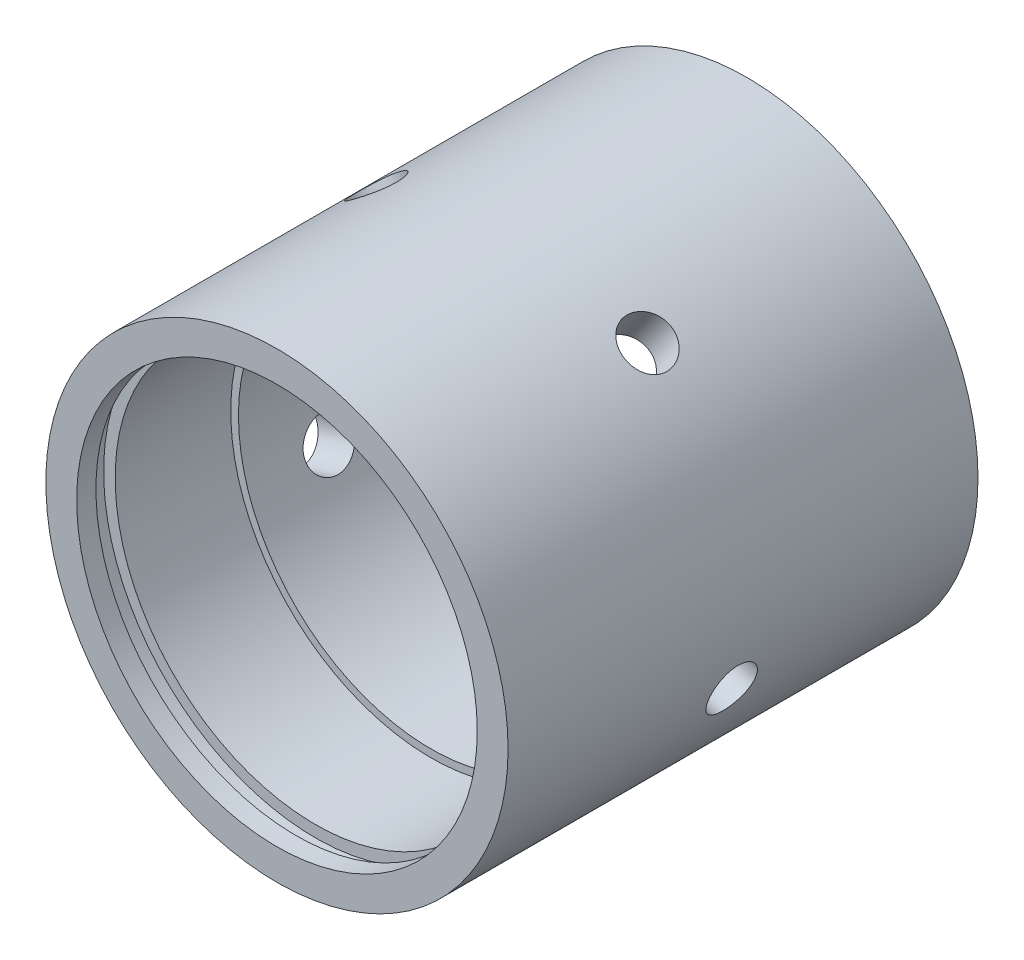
ISO-10303-21;
HEADER;
FILE_DESCRIPTION(('STEP AP214'),'2;1');
FILE_NAME('part.step','',(''),(''),'','','');
FILE_SCHEMA(('AUTOMOTIVE_DESIGN { 1 0 10303 214 1 1 1 1 }'));
ENDSEC;
DATA;
#1=APPLICATION_CONTEXT('core data for automotive mechanical design processes');
#2=APPLICATION_PROTOCOL_DEFINITION('international standard','automotive_design',2000,#1);
#3=PRODUCT_CONTEXT('',#1,'mechanical');
#4=PRODUCT('Part','Part','',(#3));
#5=PRODUCT_RELATED_PRODUCT_CATEGORY('part','',(#4));
#6=PRODUCT_DEFINITION_FORMATION('','',#4);
#7=PRODUCT_DEFINITION_CONTEXT('part definition',#1,'design');
#8=PRODUCT_DEFINITION('design','',#6,#7);
#9=PRODUCT_DEFINITION_SHAPE('','',#8);
#10=(LENGTH_UNIT() NAMED_UNIT(*) SI_UNIT(.MILLI.,.METRE.));
#11=(NAMED_UNIT(*) PLANE_ANGLE_UNIT() SI_UNIT($,.RADIAN.));
#12=(NAMED_UNIT(*) SI_UNIT($,.STERADIAN.) SOLID_ANGLE_UNIT());
#13=UNCERTAINTY_MEASURE_WITH_UNIT(LENGTH_MEASURE(1.E-05),#10,'distance_accuracy_value','');
#14=(GEOMETRIC_REPRESENTATION_CONTEXT(3) GLOBAL_UNCERTAINTY_ASSIGNED_CONTEXT((#13)) GLOBAL_UNIT_ASSIGNED_CONTEXT((#10,
#11,#12)) REPRESENTATION_CONTEXT('',''));
#15=CARTESIAN_POINT('',(0.,0.,0.));
#16=DIRECTION('',(0.,0.,1.));
#17=DIRECTION('',(1.,0.,0.));
#18=AXIS2_PLACEMENT_3D('',#15,#16,#17);
#19=CARTESIAN_POINT('',(0.,0.,-10.5));
#20=DIRECTION('',(0.,0.,-1.));
#21=DIRECTION('',(-1.,0.,0.));
#22=AXIS2_PLACEMENT_3D('',#19,#20,#21);
#23=CYLINDRICAL_SURFACE('',#22,26.);
#24=CARTESIAN_POINT('',(0.,0.,-10.5));
#25=DIRECTION('',(0.,0.,1.));
#26=DIRECTION('',(1.,0.,0.));
#27=AXIS2_PLACEMENT_3D('',#24,#25,#26);
#28=CIRCLE('',#27,26.);
#29=CARTESIAN_POINT('',(26.,0.,-10.5));
#30=VERTEX_POINT('',#29);
#31=EDGE_CURVE('E43',#30,#30,#28,.T.);
#32=ORIENTED_EDGE('',*,*,#31,.T.);
#33=EDGE_LOOP('',(#32));
#34=FACE_BOUND('',#33,.T.);
#35=CARTESIAN_POINT('',(0.,0.,-25.5));
#36=DIRECTION('',(0.,0.,-1.));
#37=DIRECTION('',(-1.,0.,0.));
#38=AXIS2_PLACEMENT_3D('',#35,#36,#37);
#39=CIRCLE('',#38,26.);
#40=CARTESIAN_POINT('',(-26.,0.,-25.5));
#41=VERTEX_POINT('',#40);
#42=EDGE_CURVE('E50',#41,#41,#39,.T.);
#43=ORIENTED_EDGE('',*,*,#42,.T.);
#44=EDGE_LOOP('',(#43));
#45=FACE_BOUND('',#44,.T.);
#46=ADVANCED_FACE('F24',(#34,#45),#23,.F.);
#47=CARTESIAN_POINT('',(0.,0.,10.5));
#48=DIRECTION('',(0.,0.,1.));
#49=DIRECTION('',(1.,0.,0.));
#50=AXIS2_PLACEMENT_3D('',#47,#48,#49);
#51=CYLINDRICAL_SURFACE('',#50,26.);
#52=CARTESIAN_POINT('',(0.,0.,10.5));
#53=DIRECTION('',(0.,0.,1.));
#54=DIRECTION('',(1.,0.,0.));
#55=AXIS2_PLACEMENT_3D('',#52,#53,#54);
#56=CIRCLE('',#55,26.);
#57=CARTESIAN_POINT('',(26.,0.,10.5));
#58=VERTEX_POINT('',#57);
#59=EDGE_CURVE('E32',#58,#58,#56,.T.);
#60=ORIENTED_EDGE('',*,*,#59,.F.);
#61=EDGE_LOOP('',(#60));
#62=FACE_BOUND('',#61,.T.);
#63=CARTESIAN_POINT('',(0.,0.,25.5));
#64=DIRECTION('',(0.,0.,1.));
#65=DIRECTION('',(1.,0.,0.));
#66=AXIS2_PLACEMENT_3D('',#63,#64,#65);
#67=CIRCLE('',#66,26.);
#68=CARTESIAN_POINT('',(26.,0.,25.5));
#69=VERTEX_POINT('',#68);
#70=EDGE_CURVE('E44',#69,#69,#67,.F.);
#71=ORIENTED_EDGE('',*,*,#70,.F.);
#72=EDGE_LOOP('',(#71));
#73=FACE_BOUND('',#72,.T.);
#74=ADVANCED_FACE('F100',(#62,#73),#51,.F.);
#75=CARTESIAN_POINT('',(0.,0.,28.5));
#76=DIRECTION('',(0.,0.,-1.));
#77=DIRECTION('',(-1.,0.,0.));
#78=AXIS2_PLACEMENT_3D('',#75,#76,#77);
#79=CYLINDRICAL_SURFACE('',#78,25.);
#80=CARTESIAN_POINT('',(-24.5696865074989,-4.61849595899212,0.));
#81=CARTESIAN_POINT('',(-24.5696866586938,-4.6185039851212,-0.178953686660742));
#82=CARTESIAN_POINT('',(-24.5668945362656,-4.63342603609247,-0.358018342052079));
#83=CARTESIAN_POINT('',(-24.5556462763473,-4.69266553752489,-0.711161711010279));
#84=CARTESIAN_POINT('',(-24.5471842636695,-4.73701347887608,-0.885235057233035));
#85=CARTESIAN_POINT('',(-24.5243925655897,-4.85362505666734,-1.22323188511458));
#86=CARTESIAN_POINT('',(-24.5100669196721,-4.92586947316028,-1.38716226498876));
#87=CARTESIAN_POINT('',(-24.4752678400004,-5.09595563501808,-1.70039360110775));
#88=CARTESIAN_POINT('',(-24.4547954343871,-5.19379309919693,-1.84969699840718));
#89=CARTESIAN_POINT('',(-24.407295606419,-5.41262284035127,-2.13034115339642));
#90=CARTESIAN_POINT('',(-24.3802344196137,-5.53373368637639,-2.26158375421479));
#91=CARTESIAN_POINT('',(-24.3194314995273,-5.79510294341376,-2.50153263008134));
#92=CARTESIAN_POINT('',(-24.2856894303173,-5.9353623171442,-2.61023777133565));
#93=CARTESIAN_POINT('',(-24.2114336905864,-6.23135659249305,-2.80237929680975));
#94=CARTESIAN_POINT('',(-24.1708969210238,-6.38714352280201,-2.88572665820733));
#95=CARTESIAN_POINT('',(-24.0835068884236,-6.70913507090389,-3.02421638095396));
#96=CARTESIAN_POINT('',(-24.0366538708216,-6.8753392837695,-3.07935983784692));
#97=CARTESIAN_POINT('',(-23.9376963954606,-7.21230486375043,-3.1595826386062));
#98=CARTESIAN_POINT('',(-23.8856221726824,-7.38303621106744,-3.18482533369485));
#99=CARTESIAN_POINT('',(-23.7772451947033,-7.72494427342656,-3.20503641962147));
#100=CARTESIAN_POINT('',(-23.7209426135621,-7.89612096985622,-3.20000605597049));
#101=CARTESIAN_POINT('',(-23.6061177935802,-8.23302513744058,-3.15994450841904));
#102=CARTESIAN_POINT('',(-23.5476104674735,-8.39877862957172,-3.12508901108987));
#103=CARTESIAN_POINT('',(-23.4300676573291,-8.72131944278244,-3.02664137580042));
#104=CARTESIAN_POINT('',(-23.3710321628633,-8.8781065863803,-2.96304866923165));
#105=CARTESIAN_POINT('',(-23.2545194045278,-9.17896796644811,-2.80874572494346));
#106=CARTESIAN_POINT('',(-23.197046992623,-9.32300518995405,-2.71795968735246));
#107=CARTESIAN_POINT('',(-23.0862210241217,-9.59415901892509,-2.51190232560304));
#108=CARTESIAN_POINT('',(-23.0328676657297,-9.72127481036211,-2.39662982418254));
#109=CARTESIAN_POINT('',(-22.9322930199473,-9.95622514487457,-2.14388828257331));
#110=CARTESIAN_POINT('',(-22.88511841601,-10.0639149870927,-2.00626609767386));
#111=CARTESIAN_POINT('',(-22.7996119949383,-10.2561590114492,-1.7132572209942));
#112=CARTESIAN_POINT('',(-22.7612802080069,-10.3407131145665,-1.55787046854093));
#113=CARTESIAN_POINT('',(-22.6953778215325,-10.4845657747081,-1.23360529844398));
#114=CARTESIAN_POINT('',(-22.6678121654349,-10.5438527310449,-1.06472072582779));
#115=CARTESIAN_POINT('',(-22.6249243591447,-10.6355716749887,-0.718326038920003));
#116=CARTESIAN_POINT('',(-22.609601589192,-10.6680050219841,-0.540816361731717));
#117=CARTESIAN_POINT('',(-22.5920937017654,-10.7050327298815,-0.183554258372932));
#118=CARTESIAN_POINT('',(-22.5898164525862,-10.7098223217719,-0.00382656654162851));
#119=CARTESIAN_POINT('',(-22.5982761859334,-10.6919599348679,0.353947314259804));
#120=CARTESIAN_POINT('',(-22.6090128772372,-10.6693085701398,0.531993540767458));
#121=CARTESIAN_POINT('',(-22.6428588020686,-10.5972875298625,0.880706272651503));
#122=CARTESIAN_POINT('',(-22.6659240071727,-10.5480129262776,1.05139671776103));
#123=CARTESIAN_POINT('',(-22.7231915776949,-10.4240681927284,1.38130221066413));
#124=CARTESIAN_POINT('',(-22.7573943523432,-10.3493971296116,1.54051683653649));
#125=CARTESIAN_POINT('',(-22.8354326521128,-10.1760535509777,1.84391905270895));
#126=CARTESIAN_POINT('',(-22.8793204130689,-10.0772505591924,1.98801865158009));
#127=CARTESIAN_POINT('',(-22.9744954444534,-9.85833499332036,2.25620180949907));
#128=CARTESIAN_POINT('',(-23.0257830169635,-9.73822154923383,2.38028455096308));
#129=CARTESIAN_POINT('',(-23.1337363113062,-9.47892640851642,2.60566586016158));
#130=CARTESIAN_POINT('',(-23.1904323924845,-9.33963486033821,2.70682357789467));
#131=CARTESIAN_POINT('',(-23.3064781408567,-9.04615614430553,2.88250800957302));
#132=CARTESIAN_POINT('',(-23.3658277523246,-8.89196928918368,2.95703528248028));
#133=CARTESIAN_POINT('',(-23.4846255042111,-8.57328278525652,3.07711150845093));
#134=CARTESIAN_POINT('',(-23.544072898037,-8.40881336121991,3.12274137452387));
#135=CARTESIAN_POINT('',(-23.6610727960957,-8.07372952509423,3.18399060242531));
#136=CARTESIAN_POINT('',(-23.7186253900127,-7.90311540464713,3.19961138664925));
#137=CARTESIAN_POINT('',(-23.829615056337,-7.56183955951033,3.20037155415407));
#138=CARTESIAN_POINT('',(-23.8830785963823,-7.3911868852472,3.18572793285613));
#139=CARTESIAN_POINT('',(-23.9849710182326,-7.0535293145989,3.12683516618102));
#140=CARTESIAN_POINT('',(-24.0333999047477,-6.88652441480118,3.08258604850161));
#141=CARTESIAN_POINT('',(-24.1242789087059,-6.56107653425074,2.96580751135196));
#142=CARTESIAN_POINT('',(-24.1667313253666,-6.40263027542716,2.89328900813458));
#143=CARTESIAN_POINT('',(-24.2451797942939,-6.09884410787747,2.72205274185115));
#144=CARTESIAN_POINT('',(-24.2811757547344,-5.95350438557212,2.6233346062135));
#145=CARTESIAN_POINT('',(-24.3467898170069,-5.67924961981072,2.40170035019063));
#146=CARTESIAN_POINT('',(-24.3763624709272,-5.55045409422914,2.2786228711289));
#147=CARTESIAN_POINT('',(-24.4289314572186,-5.31431854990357,2.01209970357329));
#148=CARTESIAN_POINT('',(-24.4519262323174,-5.20698361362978,1.86864920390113));
#149=CARTESIAN_POINT('',(-24.491669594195,-5.01673527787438,1.56478358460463));
#150=CARTESIAN_POINT('',(-24.5083925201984,-4.93392249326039,1.40430214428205));
#151=CARTESIAN_POINT('',(-24.5357501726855,-4.79603472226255,1.07148696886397));
#152=CARTESIAN_POINT('',(-24.5463914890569,-4.740929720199,0.899166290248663));
#153=CARTESIAN_POINT('',(-24.559330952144,-4.67332764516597,0.604971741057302));
#154=CARTESIAN_POINT('',(-24.5632176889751,-4.65279846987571,0.484949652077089));
#155=CARTESIAN_POINT('',(-24.568395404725,-4.62537995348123,0.243302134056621));
#156=CARTESIAN_POINT('',(-24.5696864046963,-4.61849050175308,0.121676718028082));
#157=CARTESIAN_POINT('',(-24.5696865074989,-4.61849595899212,0.));
#158=B_SPLINE_CURVE_WITH_KNOTS('',3,(#80,#81,#82,#83,#84,#85,#86,#87,#88,#89,#90,#91,#92,#93,
#94,#95,#96,#97,#98,#99,#100,#101,#102,#103,#104,#105,#106,#107,#108,#109,#110,#111,#112,#113,
#114,#115,#116,#117,#118,#119,#120,#121,#122,#123,#124,#125,#126,#127,#128,#129,#130,#131,#132,
#133,#134,#135,#136,#137,#138,#139,#140,#141,#142,#143,#144,#145,#146,#147,#148,#149,#150,#151,
#152,#153,#154,#155,#156,#157),.UNSPECIFIED.,.T.,.F.,(4,2,2,2,2,2,2,2,2,2,2,2,2,2,2,2,2,2,2,2,2,
2,2,2,2,2,2,2,2,2,2,2,2,2,2,2,2,2,4),(0.,0.536416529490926,1.07338975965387,1.60999368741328,
2.14650790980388,2.68583162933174,3.22518247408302,3.76640551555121,4.30760753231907,
4.8458390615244,5.38404844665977,5.91910913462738,6.4541804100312,6.99075727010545,
7.52735993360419,8.06780798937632,8.60825789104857,9.14895565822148,9.68962605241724,
10.2264733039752,10.7633085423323,11.2982392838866,11.8331896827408,12.3710990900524,
12.9090304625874,13.4501822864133,13.9913227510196,14.5309412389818,15.0705341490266,
15.6062716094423,16.1420085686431,16.677538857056,17.2130767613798,17.7522885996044,
18.2916279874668,18.8331505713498,19.3740852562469,19.7388161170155,20.1035440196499),.UNSPECIFIED.);
#159=CARTESIAN_POINT('',(-24.5696865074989,-4.61849595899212,0.));
#160=VERTEX_POINT('',#159);
#161=EDGE_CURVE('E119',#160,#160,#158,.T.);
#162=ORIENTED_EDGE('',*,*,#161,.T.);
#163=EDGE_LOOP('',(#162));
#164=FACE_BOUND('',#163,.T.);
#165=CARTESIAN_POINT('',(-11.9849013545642,21.9399667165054,0.));
#166=CARTESIAN_POINT('',(-11.9849090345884,21.93996438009,-0.178953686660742));
#167=CARTESIAN_POINT('',(-11.9982379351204,21.9326977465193,-0.358018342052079));
#168=CARTESIAN_POINT('',(-12.0511021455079,21.9036940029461,-0.711161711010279));
#169=CARTESIAN_POINT('',(-12.0906646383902,21.8819418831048,-0.885235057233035));
#170=CARTESIAN_POINT('',(-12.1945258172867,21.8242307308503,-1.22323188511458));
#171=CARTESIAN_POINT('',(-12.2588074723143,21.7882814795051,-1.38716226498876));
#172=CARTESIAN_POINT('',(-12.4098155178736,21.7026260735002,-1.70039360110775));
#173=CARTESIAN_POINT('',(-12.4965381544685,21.6529222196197,-1.84969699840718));
#174=CARTESIAN_POINT('',(-12.6899793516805,21.5401250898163,-2.13034115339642));
#175=CARTESIAN_POINT('',(-12.7968002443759,21.4769630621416,-2.2615837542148));
#176=CARTESIAN_POINT('',(-13.0265880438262,21.338368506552,-2.50153263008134));
#177=CARTESIAN_POINT('',(-13.1495557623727,21.2629353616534,-2.61023777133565));
#178=CARTESIAN_POINT('',(-13.4081167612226,21.1008466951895,-2.80237929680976));
#179=CARTESIAN_POINT('',(-13.5437523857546,21.0141531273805,-2.88572665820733));
#180=CARTESIAN_POINT('',(-13.8229795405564,20.8315394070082,-3.02421638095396));
#181=CARTESIAN_POINT('',(-13.9665707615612,20.7356196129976,-3.07935983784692));
#182=CARTESIAN_POINT('',(-14.2564645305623,20.5373773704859,-3.1595826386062));
#183=CARTESIAN_POINT('',(-14.4027478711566,20.4350929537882,-3.18482533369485));
#184=CARTESIAN_POINT('',(-14.6944314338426,20.226364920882,-3.20503641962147));
#185=CARTESIAN_POINT('',(-14.8398316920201,20.1199214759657,-3.20000605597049));
#186=CARTESIAN_POINT('',(-15.1247637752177,19.9066074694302,-3.15994450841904));
#187=CARTESIAN_POINT('',(-15.2643249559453,19.7997430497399,-3.12508901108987));
#188=CARTESIAN_POINT('',(-15.5347567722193,19.5882826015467,-3.02664137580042));
#189=CARTESIAN_POINT('',(-15.6656272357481,19.4836866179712,-2.96304866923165));
#190=CARTESIAN_POINT('',(-15.915758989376,19.2799051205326,-2.80874572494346));
#191=CARTESIAN_POINT('',(-16.0349865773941,19.1807356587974,-2.71795968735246));
#192=CARTESIAN_POINT('',(-16.2586220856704,18.9915427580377,-2.51190232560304));
#193=CARTESIAN_POINT('',(-16.3630292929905,18.9015197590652,-2.39662982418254));
#194=CARTESIAN_POINT('',(-16.5554010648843,18.7332639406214,-2.14388828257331));
#195=CARTESIAN_POINT('',(-16.6432424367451,18.6551202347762,-2.00626609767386));
#196=CARTESIAN_POINT('',(-16.7996544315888,18.5143921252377,-1.7132572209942));
#197=CARTESIAN_POINT('',(-16.8682249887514,18.451807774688,-1.55787046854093));
#198=CARTESIAN_POINT('',(-16.9846720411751,18.3446779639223,-1.23360529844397));
#199=CARTESIAN_POINT('',(-17.0325390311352,18.3001407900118,-1.06472072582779));
#200=CARTESIAN_POINT('',(-17.1065158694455,18.2310093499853,-0.718326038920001));
#201=CARTESIAN_POINT('',(-17.1326268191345,18.206414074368,-0.540816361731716));
#202=CARTESIAN_POINT('',(-17.1624320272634,18.1783208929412,-0.18355425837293));
#203=CARTESIAN_POINT('',(-17.1662834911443,18.17467503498,-0.00382656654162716));
#204=CARTESIAN_POINT('',(-17.1519095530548,18.1882405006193,0.353947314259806));
#205=CARTESIAN_POINT('',(-17.1336846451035,18.2054513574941,0.531993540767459));
#206=CARTESIAN_POINT('',(-17.0756475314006,18.2598964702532,0.880706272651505));
#207=CARTESIAN_POINT('',(-17.0359121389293,18.297059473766,1.05139671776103));
#208=CARTESIAN_POINT('',(-16.9357303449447,18.3898251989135,1.38130221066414));
#209=CARTESIAN_POINT('',(-16.8752831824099,18.4454285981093,1.5405168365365));
#210=CARTESIAN_POINT('',(-16.7345388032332,18.5732135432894,1.84391905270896));
#211=CARTESIAN_POINT('',(-16.6541336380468,18.645485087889,1.98801865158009));
#212=CARTESIAN_POINT('',(-16.4753432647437,18.8036505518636,2.25620180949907));
#213=CARTESIAN_POINT('',(-16.3769573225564,18.8895450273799,2.38028455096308));
#214=CARTESIAN_POINT('',(-16.1637123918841,19.0723413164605,2.60566586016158));
#215=CARTESIAN_POINT('',(-16.048758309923,19.1693059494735,2.70682357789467));
#216=CARTESIAN_POINT('',(-15.8055035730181,19.3703619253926,2.88250800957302));
#217=CARTESIAN_POINT('',(-15.6772031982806,19.4744531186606,2.95703528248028));
#218=CARTESIAN_POINT('',(-15.4108248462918,19.6859160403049,3.07711150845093));
#219=CARTESIAN_POINT('',(-15.272775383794,19.7932777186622,3.12274137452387));
#220=CARTESIAN_POINT('',(-14.9902466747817,20.00809783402,3.18399060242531));
#221=CARTESIAN_POINT('',(-14.8457677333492,20.1155562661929,3.19961138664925));
#222=CARTESIAN_POINT('',(-14.555492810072,20.326573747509,3.20037155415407));
#223=CARTESIAN_POINT('',(-14.4097136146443,20.4301551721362,3.18572793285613));
#224=CARTESIAN_POINT('',(-14.1200686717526,20.6314025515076,3.12683516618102));
#225=CARTESIAN_POINT('',(-13.9762029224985,20.7290685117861,3.08258604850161));
#226=CARTESIAN_POINT('',(-13.6947667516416,20.9160685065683,2.96580751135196));
#227=CARTESIAN_POINT('',(-13.5571939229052,21.0054057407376,2.89328900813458));
#228=CARTESIAN_POINT('',(-13.292518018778,21.1738897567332,2.72205274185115));
#229=CARTESIAN_POINT('',(-13.165415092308,21.2530363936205,2.62333460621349));
#230=CARTESIAN_POINT('',(-12.9248591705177,21.400188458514,2.40170035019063));
#231=CARTESIAN_POINT('',(-12.8115057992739,21.4681137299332,2.2786228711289));
#232=CARTESIAN_POINT('',(-12.6031722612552,21.5910797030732,2.01209970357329));
#233=CARTESIAN_POINT('',(-12.5081964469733,21.6461173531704,1.86864920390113));
#234=CARTESIAN_POINT('',(-12.3395409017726,21.7427055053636,1.56478358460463));
#235=CARTESIAN_POINT('',(-12.2659489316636,21.7842005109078,1.40430214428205));
#236=CARTESIAN_POINT('',(-12.1432638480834,21.8528288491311,1.07148696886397));
#237=CARTESIAN_POINT('',(-12.0941442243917,21.8799777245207,0.899166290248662));
#238=CARTESIAN_POINT('',(-12.0338493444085,21.9131740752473,0.604971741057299));
#239=CARTESIAN_POINT('',(-12.015526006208,21.9232144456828,0.484949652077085));
#240=CARTESIAN_POINT('',(-11.9910494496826,21.9366115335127,0.243302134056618));
#241=CARTESIAN_POINT('',(-11.9848961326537,21.9399683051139,0.121676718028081));
#242=CARTESIAN_POINT('',(-11.9849013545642,21.9399667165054,0.));
#243=B_SPLINE_CURVE_WITH_KNOTS('',3,(#165,#166,#167,#168,#169,#170,#171,#172,#173,#174,#175,
#176,#177,#178,#179,#180,#181,#182,#183,#184,#185,#186,#187,#188,#189,#190,#191,#192,#193,#194,
#195,#196,#197,#198,#199,#200,#201,#202,#203,#204,#205,#206,#207,#208,#209,#210,#211,#212,#213,
#214,#215,#216,#217,#218,#219,#220,#221,#222,#223,#224,#225,#226,#227,#228,#229,#230,#231,#232,
#233,#234,#235,#236,#237,#238,#239,#240,#241,#242),.UNSPECIFIED.,.T.,.F.,(4,2,2,2,2,2,2,2,2,2,2,
2,2,2,2,2,2,2,2,2,2,2,2,2,2,2,2,2,2,2,2,2,2,2,2,2,2,2,4),(0.,0.536416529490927,1.07338975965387,
1.60999368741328,2.14650790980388,2.68583162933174,3.22518247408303,3.76640551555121,
4.30760753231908,4.8458390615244,5.38404844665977,5.91910913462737,6.4541804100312,
6.99075727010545,7.52735993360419,8.06780798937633,8.60825789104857,9.14895565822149,
9.68962605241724,10.2264733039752,10.7633085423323,11.2982392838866,11.8331896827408,
12.3710990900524,12.9090304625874,13.4501822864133,13.9913227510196,14.5309412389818,
15.0705341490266,15.6062716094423,16.1420085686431,16.677538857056,17.2130767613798,
17.7522885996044,18.2916279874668,18.8331505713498,19.3740852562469,19.7388161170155,
20.1035440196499),.UNSPECIFIED.);
#244=CARTESIAN_POINT('',(-11.9849013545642,21.9399667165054,0.));
#245=VERTEX_POINT('',#244);
#246=EDGE_CURVE('E123',#245,#245,#243,.T.);
#247=ORIENTED_EDGE('',*,*,#246,.T.);
#248=EDGE_LOOP('',(#247));
#249=FACE_BOUND('',#248,.T.);
#250=CARTESIAN_POINT('',(17.1626101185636,18.1781411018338,0.));
#251=CARTESIAN_POINT('',(17.1626055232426,18.1781476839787,-0.178953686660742));
#252=CARTESIAN_POINT('',(17.1515756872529,18.1885787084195,-0.358018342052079));
#253=CARTESIAN_POINT('',(17.1076555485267,18.2298929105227,-0.711161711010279));
#254=CARTESIAN_POINT('',(17.074742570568,18.2607973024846,-0.885235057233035));
#255=CARTESIAN_POINT('',(16.9877611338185,18.3417414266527,-1.22323188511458));
#256=CARTESIAN_POINT('',(16.9337072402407,18.3917679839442,-1.38716226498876));
#257=CARTESIAN_POINT('',(16.8055800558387,18.5089161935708,-1.70039360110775));
#258=CARTESIAN_POINT('',(16.7315101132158,18.5760349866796,-1.84969699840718));
#259=CARTESIAN_POINT('',(16.5644570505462,18.725152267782,-2.13034115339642));
#260=CARTESIAN_POINT('',(16.4713769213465,18.8072268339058,-2.26158375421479));
#261=CARTESIAN_POINT('',(16.2685573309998,18.9829399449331,-2.50153263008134));
#262=CARTESIAN_POINT('',(16.158817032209,19.0765790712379,-2.61023777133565));
#263=CARTESIAN_POINT('',(15.9247618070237,19.2723970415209,-2.80237929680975));
#264=CARTESIAN_POINT('',(15.8003976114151,19.374604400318,-2.88572665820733));
#265=CARTESIAN_POINT('',(15.5404357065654,19.5837344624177,-3.02421638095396));
#266=CARTESIAN_POINT('',(15.4048384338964,19.6906569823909,-3.07935983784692));
#267=CARTESIAN_POINT('',(15.1267167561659,19.9051021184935,-3.1595826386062));
#268=CARTESIAN_POINT('',(14.9842344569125,20.0126182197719,-3.18482533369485));
#269=CARTESIAN_POINT('',(14.6955871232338,20.2255252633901,-3.20503641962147));
#270=CARTESIAN_POINT('',(14.5494222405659,20.3309162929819,-3.20000605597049));
#271=CARTESIAN_POINT('',(14.2584997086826,20.5359851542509,-3.15994450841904));
#272=CARTESIAN_POINT('',(14.1137388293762,20.6356928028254,-3.12508901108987));
#273=CARTESIAN_POINT('',(13.829059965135,20.8275438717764,-3.02664137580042));
#274=CARTESIAN_POINT('',(13.689142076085,20.9196871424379,-2.96304866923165));
#275=CARTESIAN_POINT('',(13.4180393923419,21.0946046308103,-2.80874572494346));
#276=CARTESIAN_POINT('',(13.2868802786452,21.1773517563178,-2.71795968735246));
#277=CARTESIAN_POINT('',(13.0378399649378,21.3315779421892,-2.51190232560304));
#278=CARTESIAN_POINT('',(12.9199594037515,21.403056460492,-2.39662982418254));
#279=CARTESIAN_POINT('',(12.7004924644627,21.5340189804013,-2.1438882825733));
#280=CARTESIAN_POINT('',(12.599028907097,21.5934133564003,-2.00626609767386));
#281=CARTESIAN_POINT('',(12.4168545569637,21.6986826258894,-1.7132572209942));
#282=CARTESIAN_POINT('',(12.3361438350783,21.7445574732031,-1.55787046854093));
#283=CARTESIAN_POINT('',(12.1982732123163,21.8222002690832,-1.23360529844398));
#284=CARTESIAN_POINT('',(12.1411241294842,21.8539617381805,-1.06472072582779));
#285=CARTESIAN_POINT('',(12.052516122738,21.9029551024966,-0.718326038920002));
#286=CARTESIAN_POINT('',(12.021055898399,21.9201877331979,-0.540816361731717));
#287=CARTESIAN_POINT('',(11.9851273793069,21.9398529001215,-0.183554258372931));
#288=CARTESIAN_POINT('',(11.9804697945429,21.9423892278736,-0.00382656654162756));
#289=CARTESIAN_POINT('',(11.9978131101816,21.9329107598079,0.353947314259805));
#290=CARTESIAN_POINT('',(12.0198134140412,21.920896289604,0.531993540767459));
#291=CARTESIAN_POINT('',(12.0895282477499,21.8825241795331,0.880706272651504));
#292=CARTESIAN_POINT('',(12.1371512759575,21.8562175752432,1.05139671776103));
#293=CARTESIAN_POINT('',(12.2563346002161,21.7896052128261,1.38130221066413));
#294=CARTESIAN_POINT('',(12.3278957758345,21.7492989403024,1.54051683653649));
#295=CARTESIAN_POINT('',(12.4929188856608,21.6549308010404,1.84391905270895));
#296=CARTESIAN_POINT('',(12.5864997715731,21.600794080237,1.98801865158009));
#297=CARTESIAN_POINT('',(12.7921733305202,21.4796301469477,2.25620180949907));
#298=CARTESIAN_POINT('',(12.9042667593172,21.412602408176,2.38028455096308));
#299=CARTESIAN_POINT('',(13.144012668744,21.2662815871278,2.60566586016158));
#300=CARTESIAN_POINT('',(13.2717542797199,21.1869174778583,2.70682357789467));
#301=CARTESIAN_POINT('',(13.5381397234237,21.0176981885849,2.88250800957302));
#302=CARTESIAN_POINT('',(13.6767833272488,20.9278432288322,2.95703528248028));
#303=CARTESIAN_POINT('',(13.9602119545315,20.7398479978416,3.07711150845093));
#304=CARTESIAN_POINT('',(14.1049786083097,20.641731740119,3.12274137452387));
#305=CARTESIAN_POINT('',(14.3965908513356,20.4394140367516,3.18399060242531));
#306=CARTESIAN_POINT('',(14.5434363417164,20.3352128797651,3.19961138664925));
#307=CARTESIAN_POINT('',(14.8338257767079,20.1243530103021,3.20037155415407));
#308=CARTESIAN_POINT('',(14.9773858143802,20.0177171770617,3.18572793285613));
#309=CARTESIAN_POINT('',(15.258288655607,19.8044373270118,3.12683516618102));
#310=CARTESIAN_POINT('',(15.395631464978,19.6977933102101,3.08258604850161));
#311=CARTESIAN_POINT('',(15.6604475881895,19.4879177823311,2.96580751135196));
#312=CARTESIAN_POINT('',(15.7879246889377,19.384684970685,2.89328900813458));
#313=CARTESIAN_POINT('',(16.0299518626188,19.1850276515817,2.72205274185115));
#314=CARTESIAN_POINT('',(16.1445017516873,19.088603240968,2.6233346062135));
#315=CARTESIAN_POINT('',(16.3587875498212,18.9052934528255,2.40170035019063));
#316=CARTESIAN_POINT('',(16.4584164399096,18.818478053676,2.2786228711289));
#317=CARTESIAN_POINT('',(16.6397426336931,18.6583396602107,2.01209970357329));
#318=CARTESIAN_POINT('',(16.7214356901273,18.5850198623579,1.86864920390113));
#319=CARTESIAN_POINT('',(16.8654139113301,18.4544662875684,1.56478358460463));
#320=CARTESIAN_POINT('',(16.9276191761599,18.3972988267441,1.40430214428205));
#321=CARTESIAN_POINT('',(17.0308003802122,18.3018257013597,1.07148696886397));
#322=CARTESIAN_POINT('',(17.0717992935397,18.2634996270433,0.899166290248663));
#323=CARTESIAN_POINT('',(17.122003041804,18.2164140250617,0.6049717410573));
#324=CARTESIAN_POINT('',(17.1372142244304,18.2020901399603,0.484949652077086));
#325=CARTESIAN_POINT('',(17.1575192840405,18.1829514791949,0.243302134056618));
#326=CARTESIAN_POINT('',(17.1626132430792,18.1781366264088,0.121676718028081));
#327=CARTESIAN_POINT('',(17.1626101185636,18.1781411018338,0.));
#328=B_SPLINE_CURVE_WITH_KNOTS('',3,(#250,#251,#252,#253,#254,#255,#256,#257,#258,#259,#260,
#261,#262,#263,#264,#265,#266,#267,#268,#269,#270,#271,#272,#273,#274,#275,#276,#277,#278,#279,
#280,#281,#282,#283,#284,#285,#286,#287,#288,#289,#290,#291,#292,#293,#294,#295,#296,#297,#298,
#299,#300,#301,#302,#303,#304,#305,#306,#307,#308,#309,#310,#311,#312,#313,#314,#315,#316,#317,
#318,#319,#320,#321,#322,#323,#324,#325,#326,#327),.UNSPECIFIED.,.T.,.F.,(4,2,2,2,2,2,2,2,2,2,2,
2,2,2,2,2,2,2,2,2,2,2,2,2,2,2,2,2,2,2,2,2,2,2,2,2,2,2,4),(0.,0.536416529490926,1.07338975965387,
1.60999368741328,2.14650790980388,2.68583162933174,3.22518247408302,3.76640551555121,
4.30760753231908,4.8458390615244,5.38404844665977,5.91910913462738,6.4541804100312,
6.99075727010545,7.5273599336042,8.06780798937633,8.60825789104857,9.14895565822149,
9.68962605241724,10.2264733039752,10.7633085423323,11.2982392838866,11.8331896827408,
12.3710990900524,12.9090304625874,13.4501822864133,13.9913227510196,14.5309412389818,
15.0705341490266,15.6062716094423,16.1420085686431,16.677538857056,17.2130767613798,
17.7522885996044,18.2916279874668,18.8331505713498,19.3740852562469,19.7388161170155,
20.1035440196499),.UNSPECIFIED.);
#329=CARTESIAN_POINT('',(17.1626101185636,18.1781411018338,0.));
#330=VERTEX_POINT('',#329);
#331=EDGE_CURVE('E127',#330,#330,#328,.T.);
#332=ORIENTED_EDGE('',*,*,#331,.T.);
#333=EDGE_LOOP('',(#332));
#334=FACE_BOUND('',#333,.T.);
#335=CARTESIAN_POINT('',(22.5919777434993,-10.7052576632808,0.));
#336=CARTESIAN_POINT('',(22.5919825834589,-10.7052512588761,-0.178953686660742));
#337=CARTESIAN_POINT('',(22.5984946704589,-10.6915378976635,-0.358018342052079));
#338=CARTESIAN_POINT('',(22.624214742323,-10.6370005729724,-0.711161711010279));
#339=CARTESIAN_POINT('',(22.6434358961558,-10.596148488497,-0.885235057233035));
#340=CARTESIAN_POINT('',(22.6935395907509,-10.4884111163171,-1.22323188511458));
#341=CARTESIAN_POINT('',(22.7244141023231,-10.4215437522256,-1.38716226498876));
#342=CARTESIAN_POINT('',(22.7962351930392,-10.2634867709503,-1.70039360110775));
#343=CARTESIAN_POINT('',(22.8371800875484,-10.1723012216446,-1.84969699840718));
#344=CARTESIAN_POINT('',(22.9273768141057,-9.96734454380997,-2.13034115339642));
#345=CARTESIAN_POINT('',(22.9766710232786,-9.85345764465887,-2.26158375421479));
#346=CARTESIAN_POINT('',(23.0811094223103,-9.60626641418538,-2.50153263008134));
#347=CARTESIAN_POINT('',(23.1362539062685,-9.47296110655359,-2.61023777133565));
#348=CARTESIAN_POINT('',(23.2501608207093,-9.18985027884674,-2.80237929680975));
#349=CARTESIAN_POINT('',(23.3089351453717,-9.03998908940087,-2.88572665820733));
#350=CARTESIAN_POINT('',(23.4274970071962,-8.72812588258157,-3.02421638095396));
#351=CARTESIAN_POINT('',(23.4872845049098,-8.56612433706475,-3.07935983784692));
#352=CARTESIAN_POINT('',(23.6052896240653,-8.23534771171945,-3.1595826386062));
#353=CARTESIAN_POINT('',(23.6635140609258,-8.06661469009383,-3.18482533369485));
#354=CARTESIAN_POINT('',(23.7768037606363,-7.72630286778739,-3.20503641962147));
#355=CARTESIAN_POINT('',(23.8318691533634,-7.554724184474,-3.20000605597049));
#356=CARTESIAN_POINT('',(23.937001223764,-7.21467065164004,-3.15994450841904));
#357=CARTESIAN_POINT('',(23.9870952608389,-7.04618351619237,-3.12508901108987));
#358=CARTESIAN_POINT('',(24.0815858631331,-6.71615258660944,-3.02664137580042));
#359=CARTESIAN_POINT('',(24.1259823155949,-6.55460892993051,-2.96304866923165));
#360=CARTESIAN_POINT('',(24.2085633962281,-6.24272247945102,-2.80874572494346));
#361=CARTESIAN_POINT('',(24.2467301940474,-6.09241248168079,-2.71795968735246));
#362=CARTESIAN_POINT('',(24.3164503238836,-5.80790255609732,-2.51190232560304));
#363=CARTESIAN_POINT('',(24.3480033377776,-5.67370340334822,-2.39662982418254));
#364=CARTESIAN_POINT('',(24.4047370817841,-5.42450829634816,-2.14388828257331));
#365=CARTESIAN_POINT('',(24.4298705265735,-5.30965684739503,-2.00626609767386));
#366=CARTESIAN_POINT('',(24.4736925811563,-5.10386875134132,-1.7132572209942));
#367=CARTESIAN_POINT('',(24.4923811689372,-5.01293218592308,-1.55787046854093));
#368=CARTESIAN_POINT('',(24.5236194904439,-4.85781648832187,-1.23360529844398));
#369=CARTESIAN_POINT('',(24.5361664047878,-4.79364964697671,-1.06472072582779));
#370=CARTESIAN_POINT('',(24.5553804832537,-4.69423864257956,-0.718326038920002));
#371=CARTESIAN_POINT('',(24.5620479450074,-4.65899301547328,-0.540816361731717));
#372=CARTESIAN_POINT('',(24.569648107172,-4.61874609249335,-0.183554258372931));
#373=CARTESIAN_POINT('',(24.5706210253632,-4.61353269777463,-0.00382656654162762));
#374=CARTESIAN_POINT('',(24.5669658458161,-4.63295617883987,0.353947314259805));
#375=CARTESIAN_POINT('',(24.5623378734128,-4.65759238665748,0.531993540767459));
#376=CARTESIAN_POINT('',(24.5473868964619,-4.73575276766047,0.880706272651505));
#377=CARTESIAN_POINT('',(24.5370841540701,-4.78917414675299,1.05139671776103));
#378=CARTESIAN_POINT('',(24.5105617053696,-4.92310857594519,1.38130221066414));
#379=CARTESIAN_POINT('',(24.4943417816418,-5.00362262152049,1.54051683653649));
#380=CARTESIAN_POINT('',(24.455587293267,-5.18973028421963,1.84391905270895));
#381=CARTESIAN_POINT('',(24.4330182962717,-5.29546016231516,1.98801865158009));
#382=CARTESIAN_POINT('',(24.3813411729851,-5.52850905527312,2.25620180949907));
#383=CARTESIAN_POINT('',(24.3522327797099,-5.65582895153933,2.38028455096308));
#384=CARTESIAN_POINT('',(24.2871589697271,-5.92905648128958,2.60566586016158));
#385=CARTESIAN_POINT('',(24.2511535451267,-6.07507083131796,2.70682357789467));
#386=CARTESIAN_POINT('',(24.172534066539,-6.38071007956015,2.88250800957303));
#387=CARTESIAN_POINT('',(24.1299201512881,-6.54033469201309,2.95703528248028));
#388=CARTESIAN_POINT('',(24.0387103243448,-6.86798505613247,3.07711150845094));
#389=CARTESIAN_POINT('',(23.9901315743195,-7.03598591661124,3.12274137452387));
#390=CARTESIAN_POINT('',(23.8878291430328,-7.37584524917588,3.18399060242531));
#391=CARTESIAN_POINT('',(23.8341057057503,-7.54770353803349,3.19961138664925));
#392=CARTESIAN_POINT('',(23.7233013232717,-7.88903958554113,3.20037155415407));
#393=CARTESIAN_POINT('',(23.6662471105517,-8.05852557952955,3.18572793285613));
#394=CARTESIAN_POINT('',(23.5502096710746,-8.39158715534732,3.12683516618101));
#395=CARTESIAN_POINT('',(23.4912264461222,-8.55516274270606,3.08258604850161));
#396=CARTESIAN_POINT('',(23.3734556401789,-8.87187294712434,2.96580751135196));
#397=CARTESIAN_POINT('',(23.3146679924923,-9.02501156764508,2.89328900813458));
#398=CARTESIAN_POINT('',(23.199573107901,-9.31689059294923,2.72205274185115));
#399=CARTESIAN_POINT('',(23.1432659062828,-9.45563079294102,2.62333460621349));
#400=CARTESIAN_POINT('',(23.0351458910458,-9.71607453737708,2.40170035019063));
#401=CARTESIAN_POINT('',(22.983366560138,-9.83765467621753,2.2786228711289));
#402=CARTESIAN_POINT('',(22.8870987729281,-10.0595916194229,2.01209970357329));
#403=CARTESIAN_POINT('',(22.8426120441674,-10.1599433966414,1.86864920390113));
#404=CARTESIAN_POINT('',(22.7629399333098,-10.3372180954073,1.56478358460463));
#405=CARTESIAN_POINT('',(22.7277929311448,-10.4140445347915,1.40430214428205));
#406=CARTESIAN_POINT('',(22.6688773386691,-10.5416785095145,1.07148696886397));
#407=CARTESIAN_POINT('',(22.6450964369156,-10.5925142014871,0.899166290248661));
#408=CARTESIAN_POINT('',(22.6158291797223,-10.654811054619,0.6049717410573));
#409=CARTESIAN_POINT('',(22.606906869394,-10.6737040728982,0.484949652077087));
#410=CARTESIAN_POINT('',(22.5949795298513,-10.6989295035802,0.243302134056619));
#411=CARTESIAN_POINT('',(22.5919744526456,-10.705262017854,0.121676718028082));
#412=CARTESIAN_POINT('',(22.5919777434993,-10.7052576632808,0.));
#413=B_SPLINE_CURVE_WITH_KNOTS('',3,(#335,#336,#337,#338,#339,#340,#341,#342,#343,#344,#345,
#346,#347,#348,#349,#350,#351,#352,#353,#354,#355,#356,#357,#358,#359,#360,#361,#362,#363,#364,
#365,#366,#367,#368,#369,#370,#371,#372,#373,#374,#375,#376,#377,#378,#379,#380,#381,#382,#383,
#384,#385,#386,#387,#388,#389,#390,#391,#392,#393,#394,#395,#396,#397,#398,#399,#400,#401,#402,
#403,#404,#405,#406,#407,#408,#409,#410,#411,#412),.UNSPECIFIED.,.T.,.F.,(4,2,2,2,2,2,2,2,2,2,2,
2,2,2,2,2,2,2,2,2,2,2,2,2,2,2,2,2,2,2,2,2,2,2,2,2,2,2,4),(0.,0.536416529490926,1.07338975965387,
1.60999368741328,2.14650790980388,2.68583162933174,3.22518247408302,3.76640551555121,
4.30760753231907,4.8458390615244,5.38404844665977,5.91910913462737,6.4541804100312,
6.99075727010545,7.5273599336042,8.06780798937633,8.60825789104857,9.14895565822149,
9.68962605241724,10.2264733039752,10.7633085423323,11.2982392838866,11.8331896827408,
12.3710990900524,12.9090304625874,13.4501822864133,13.9913227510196,14.5309412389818,
15.0705341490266,15.6062716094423,16.1420085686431,16.677538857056,17.2130767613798,
17.7522885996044,18.2916279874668,18.8331505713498,19.3740852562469,19.7388161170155,
20.1035440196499),.UNSPECIFIED.);
#414=CARTESIAN_POINT('',(22.5919777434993,-10.7052576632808,0.));
#415=VERTEX_POINT('',#414);
#416=EDGE_CURVE('E131',#415,#415,#413,.T.);
#417=ORIENTED_EDGE('',*,*,#416,.T.);
#418=EDGE_LOOP('',(#417));
#419=FACE_BOUND('',#418,.T.);
#420=CARTESIAN_POINT('',(0.,-25.,3.2));
#421=CARTESIAN_POINT('',(-0.178960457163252,-24.9999974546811,3.19999241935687));
#422=CARTESIAN_POINT('',(-0.358031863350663,-24.998058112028,3.18493679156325));
#423=CARTESIAN_POINT('',(-0.711189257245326,-24.9905082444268,3.12511600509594));
#424=CARTESIAN_POINT('',(-0.885269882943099,-24.9848939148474,3.08032005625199));
#425=CARTESIAN_POINT('',(-1.22328210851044,-24.9706263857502,2.96236217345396));
#426=CARTESIAN_POINT('',(-1.38722054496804,-24.9619752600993,2.88921959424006));
#427=CARTESIAN_POINT('',(-1.70046539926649,-24.9425956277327,2.71668760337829));
#428=CARTESIAN_POINT('',(-1.84977426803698,-24.9318674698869,2.61730259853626));
#429=CARTESIAN_POINT('',(-2.1304123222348,-24.9094619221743,2.39449503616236));
#430=CARTESIAN_POINT('',(-2.26164506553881,-24.8977799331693,2.27095145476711));
#431=CARTESIAN_POINT('',(-2.50157489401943,-24.874820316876,2.0035936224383));
#432=CARTESIAN_POINT('',(-2.61027081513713,-24.8635427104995,1.85977832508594));
#433=CARTESIAN_POINT('',(-2.80240263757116,-24.8426235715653,1.55533023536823));
#434=CARTESIAN_POINT('',(-2.88574783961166,-24.8329879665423,1.39463976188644));
#435=CARTESIAN_POINT('',(-3.02423308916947,-24.8165047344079,1.06139880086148));
#436=CARTESIAN_POINT('',(-3.07937425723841,-24.8096569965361,0.888848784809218));
#437=CARTESIAN_POINT('',(-3.15959236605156,-24.7995689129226,0.537789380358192));
#438=CARTESIAN_POINT('',(-3.1848324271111,-24.7963090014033,0.359317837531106));
#439=CARTESIAN_POINT('',(-3.20503666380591,-24.7937058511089,0.000644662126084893));
#440=CARTESIAN_POINT('',(-3.2000021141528,-24.7943624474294,-0.179556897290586));
#441=CARTESIAN_POINT('',(-3.15993387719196,-24.7995002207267,-0.535436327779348));
#442=CARTESIAN_POINT('',(-3.12508009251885,-24.8039584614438,-0.711134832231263));
#443=CARTESIAN_POINT('',(-3.02664355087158,-24.8161614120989,-1.05416860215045));
#444=CARTESIAN_POINT('',(-2.96306018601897,-24.8239061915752,-1.22150369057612));
#445=CARTESIAN_POINT('',(-2.80877671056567,-24.841835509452,-1.54361820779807));
#446=CARTESIAN_POINT('',(-2.71799864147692,-24.8520270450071,-1.69835989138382));
#447=CARTESIAN_POINT('',(-2.5119583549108,-24.8736961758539,-1.99048136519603));
#448=CARTESIAN_POINT('',(-2.39669496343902,-24.8851738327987,-2.12786032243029));
#449=CARTESIAN_POINT('',(-2.14395996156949,-24.9082238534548,-2.38240070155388));
#450=CARTESIAN_POINT('',(-2.00633332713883,-24.9197963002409,-2.49940824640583));
#451=CARTESIAN_POINT('',(-1.7133117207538,-24.9416541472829,-2.70868552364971));
#452=CARTESIAN_POINT('',(-1.55791670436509,-24.95193954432,-2.80095519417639));
#453=CARTESIAN_POINT('',(-1.23364913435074,-24.9700712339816,-2.95813849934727));
#454=CARTESIAN_POINT('',(-1.06477173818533,-24.9779166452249,-3.02304225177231));
#455=CARTESIAN_POINT('',(-0.718392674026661,-24.9902764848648,-3.12352790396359));
#456=CARTESIAN_POINT('',(-0.540891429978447,-24.9947910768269,-3.15911124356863));
#457=CARTESIAN_POINT('',(-0.183633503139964,-24.9999593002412,-3.19974598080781));
#458=CARTESIAN_POINT('',(-0.00390129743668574,-25.0006397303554,-3.20500930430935));
#459=CARTESIAN_POINT('',(0.353882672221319,-24.998135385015,-3.18541423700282));
#460=CARTESIAN_POINT('',(0.531934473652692,-24.9949506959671,-3.16055651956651));
#461=CARTESIAN_POINT('',(0.880676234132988,-24.9850906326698,-3.08160106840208));
#462=CARTESIAN_POINT('',(1.05138949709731,-24.9784273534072,-3.02760462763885));
#463=CARTESIAN_POINT('',(1.38133799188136,-24.9623559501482,-2.89200996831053));
#464=CARTESIAN_POINT('',(1.54057281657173,-24.952947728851,-2.81041077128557));
#465=CARTESIAN_POINT('',(1.84398920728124,-24.9323681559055,-2.62141588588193));
#466=CARTESIAN_POINT('',(1.98808492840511,-24.9211875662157,-2.51388340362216));
#467=CARTESIAN_POINT('',(2.25625878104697,-24.8983422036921,-2.27626758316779));
#468=CARTESIAN_POINT('',(2.38033607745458,-24.8866774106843,-2.14618330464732));
#469=CARTESIAN_POINT('',(2.60570503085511,-24.8640953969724,-1.8662218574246));
#470=CARTESIAN_POINT('',(2.70685602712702,-24.8531830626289,-1.7162310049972));
#471=CARTESIAN_POINT('',(2.8825286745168,-24.8334225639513,-1.4012645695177));
#472=CARTESIAN_POINT('',(2.95705088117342,-24.824574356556,-1.23628929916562));
#473=CARTESIAN_POINT('',(3.07712388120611,-24.8099774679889,-0.89648710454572));
#474=CARTESIAN_POINT('',(3.12275339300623,-24.804220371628,-0.721688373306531));
#475=CARTESIAN_POINT('',(3.18399894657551,-24.7964336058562,-0.366831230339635));
#476=CARTESIAN_POINT('',(3.19961645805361,-24.7944037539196,-0.18677307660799));
#477=CARTESIAN_POINT('',(3.20036683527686,-24.7943067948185,0.172092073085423));
#478=CARTESIAN_POINT('',(3.18572069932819,-24.7962109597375,0.350898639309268));
#479=CARTESIAN_POINT('',(3.12682813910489,-24.8037056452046,0.70348609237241));
#480=CARTESIAN_POINT('',(3.08258171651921,-24.8092961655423,0.877266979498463));
#481=CARTESIAN_POINT('',(2.96581470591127,-24.823524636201,1.21483739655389));
#482=CARTESIAN_POINT('',(2.89330530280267,-24.8321613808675,1.37863084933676));
#483=CARTESIAN_POINT('',(2.72209233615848,-24.8515110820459,1.69176152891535));
#484=CARTESIAN_POINT('',(2.62338838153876,-24.8622240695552,1.84109853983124));
#485=CARTESIAN_POINT('',(2.40177001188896,-24.8846128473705,2.12220622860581));
#486=CARTESIAN_POINT('',(2.27869097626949,-24.8962948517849,2.25384663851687));
#487=CARTESIAN_POINT('',(2.01216048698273,-24.9192508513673,2.49468931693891));
#488=CARTESIAN_POINT('',(1.8687042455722,-24.930524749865,2.60388629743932));
#489=CARTESIAN_POINT('',(1.56483366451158,-24.9514441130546,2.79711527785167));
#490=CARTESIAN_POINT('',(1.40435404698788,-24.9610829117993,2.8810452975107));
#491=CARTESIAN_POINT('',(1.07154267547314,-24.9775788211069,3.0206439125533));
#492=CARTESIAN_POINT('',(0.899223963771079,-24.9844389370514,3.07634305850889));
#493=CARTESIAN_POINT('',(0.605021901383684,-24.9929604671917,3.14464269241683));
#494=CARTESIAN_POINT('',(0.484989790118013,-24.9955873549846,3.16537164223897));
#495=CARTESIAN_POINT('',(0.243322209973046,-24.9991079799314,3.19305281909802));
#496=CARTESIAN_POINT('',(0.12168675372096,-25.0000017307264,3.20000515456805));
#497=CARTESIAN_POINT('',(0.,-25.,3.2));
#498=B_SPLINE_CURVE_WITH_KNOTS('',3,(#420,#421,#422,#423,#424,#425,#426,#427,#428,#429,#430,
#431,#432,#433,#434,#435,#436,#437,#438,#439,#440,#441,#442,#443,#444,#445,#446,#447,#448,#449,
#450,#451,#452,#453,#454,#455,#456,#457,#458,#459,#460,#461,#462,#463,#464,#465,#466,#467,#468,
#469,#470,#471,#472,#473,#474,#475,#476,#477,#478,#479,#480,#481,#482,#483,#484,#485,#486,#487,
#488,#489,#490,#491,#492,#493,#494,#495,#496,#497),.UNSPECIFIED.,.T.,.F.,(4,2,2,2,2,2,2,2,2,2,2,
2,2,2,2,2,2,2,2,2,2,2,2,2,2,2,2,2,2,2,2,2,2,2,2,2,2,2,4),(0.,0.53643686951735,1.07342998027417,
1.61005708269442,2.14659412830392,2.68589122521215,3.22521617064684,3.76644859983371,
4.3076595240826,4.84590416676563,5.38412614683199,5.91912369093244,6.45413255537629,
6.99069003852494,7.52727325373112,8.06774860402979,8.60822530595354,9.14889701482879,
9.68954217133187,10.2264037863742,10.7632533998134,11.2982487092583,11.8332629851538,
12.3711635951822,12.9090866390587,13.450225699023,13.9913534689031,14.5310005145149,
15.0706211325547,15.6063151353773,16.1420091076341,16.6774912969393,17.2129814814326,
17.7522197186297,18.2915848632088,18.8330986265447,19.3740251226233,19.7387860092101,
20.1035440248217),.UNSPECIFIED.);
#499=CARTESIAN_POINT('',(0.,-25.,3.2));
#500=VERTEX_POINT('',#499);
#501=EDGE_CURVE('E134',#500,#500,#498,.T.);
#502=ORIENTED_EDGE('',*,*,#501,.T.);
#503=EDGE_LOOP('',(#502));
#504=FACE_BOUND('',#503,.T.);
#505=CARTESIAN_POINT('',(0.,0.,10.5));
#506=DIRECTION('',(0.,0.,1.));
#507=DIRECTION('',(1.,0.,0.));
#508=AXIS2_PLACEMENT_3D('',#505,#506,#507);
#509=CIRCLE('',#508,25.);
#510=CARTESIAN_POINT('',(25.,0.,10.5));
#511=VERTEX_POINT('',#510);
#512=EDGE_CURVE('E10',#511,#511,#509,.T.);
#513=ORIENTED_EDGE('',*,*,#512,.T.);
#514=EDGE_LOOP('',(#513));
#515=FACE_BOUND('',#514,.T.);
#516=CARTESIAN_POINT('',(0.,0.,-10.5));
#517=DIRECTION('',(0.,0.,-1.));
#518=DIRECTION('',(-1.,0.,0.));
#519=AXIS2_PLACEMENT_3D('',#516,#517,#518);
#520=CIRCLE('',#519,25.);
#521=CARTESIAN_POINT('',(-25.,0.,-10.5));
#522=VERTEX_POINT('',#521);
#523=EDGE_CURVE('E37',#522,#522,#520,.T.);
#524=ORIENTED_EDGE('',*,*,#523,.T.);
#525=EDGE_LOOP('',(#524));
#526=FACE_BOUND('',#525,.T.);
#527=ADVANCED_FACE('F104',(#164,#249,#334,#419,#504,#515,#526),#79,.F.);
#528=CARTESIAN_POINT('',(0.,0.,28.5));
#529=DIRECTION('',(0.,0.,-1.));
#530=DIRECTION('',(-1.,0.,0.));
#531=AXIS2_PLACEMENT_3D('',#528,#529,#530);
#532=CYLINDRICAL_SURFACE('',#531,30.);
#533=CARTESIAN_POINT('',(-29.3577718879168,-6.17423920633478,0.));
#534=CARTESIAN_POINT('',(-29.3577716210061,-6.17424724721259,-0.179195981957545));
#535=CARTESIAN_POINT('',(-29.3546571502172,-6.18910723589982,-0.358508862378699));
#536=CARTESIAN_POINT('',(-29.3421522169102,-6.24811793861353,-0.712158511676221));
#537=CARTESIAN_POINT('',(-29.3327549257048,-6.29230052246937,-0.886489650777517));
#538=CARTESIAN_POINT('',(-29.3075807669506,-6.40852739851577,-1.22500350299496));
#539=CARTESIAN_POINT('',(-29.2918078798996,-6.48055430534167,-1.3891924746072));
#540=CARTESIAN_POINT('',(-29.2537575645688,-6.65020221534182,-1.70289047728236));
#541=CARTESIAN_POINT('',(-29.2314813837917,-6.74781830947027,-1.85240231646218));
#542=CARTESIAN_POINT('',(-29.1802402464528,-6.96607158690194,-2.13315168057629));
#543=CARTESIAN_POINT('',(-29.1512510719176,-7.08679184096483,-2.26432021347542));
#544=CARTESIAN_POINT('',(-29.0866610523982,-7.34738951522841,-2.50406498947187));
#545=CARTESIAN_POINT('',(-29.051059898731,-7.48726782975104,-2.61264017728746));
#546=CARTESIAN_POINT('',(-28.9733991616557,-7.78238019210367,-2.80435728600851));
#547=CARTESIAN_POINT('',(-28.9313243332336,-7.93765017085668,-2.88743774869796));
#548=CARTESIAN_POINT('',(-28.8413279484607,-8.25866571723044,-3.02541377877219));
#549=CARTESIAN_POINT('',(-28.793406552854,-8.42441099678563,-3.08031012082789));
#550=CARTESIAN_POINT('',(-28.6928236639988,-8.76085408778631,-3.16015616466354));
#551=CARTESIAN_POINT('',(-28.6401810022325,-8.93153053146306,-3.18521960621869));
#552=CARTESIAN_POINT('',(-28.5312913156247,-9.27348946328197,-3.20504046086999));
#553=CARTESIAN_POINT('',(-28.4750443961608,-9.44477193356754,-3.1997987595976));
#554=CARTESIAN_POINT('',(-28.3608356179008,-9.78236366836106,-3.15925015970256));
#555=CARTESIAN_POINT('',(-28.3028816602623,-9.948690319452,-3.12406556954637));
#556=CARTESIAN_POINT('',(-28.186974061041,-10.2724916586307,-3.02482065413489));
#557=CARTESIAN_POINT('',(-28.1290204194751,-10.4299662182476,-2.96075990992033));
#558=CARTESIAN_POINT('',(-28.0151346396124,-10.7321190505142,-2.80544802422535));
#559=CARTESIAN_POINT('',(-27.9592067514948,-10.8767712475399,-2.71414305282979));
#560=CARTESIAN_POINT('',(-27.8517243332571,-11.1491219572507,-2.50697362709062));
#561=CARTESIAN_POINT('',(-27.8001699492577,-11.2768199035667,-2.39110835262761));
#562=CARTESIAN_POINT('',(-27.7033853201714,-11.512549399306,-2.13742013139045));
#563=CARTESIAN_POINT('',(-27.6581878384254,-11.6204798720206,-1.99949073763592));
#564=CARTESIAN_POINT('',(-27.5764720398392,-11.8130932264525,-1.70595781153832));
#565=CARTESIAN_POINT('',(-27.5399537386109,-11.8977760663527,-1.55035424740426));
#566=CARTESIAN_POINT('',(-27.4773229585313,-12.0417156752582,-1.22580515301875));
#567=CARTESIAN_POINT('',(-27.4512131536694,-12.1009659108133,-1.05685620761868));
#568=CARTESIAN_POINT('',(-27.4107037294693,-12.1924503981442,-0.710454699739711));
#569=CARTESIAN_POINT('',(-27.3963037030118,-12.2246855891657,-0.533002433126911));
#570=CARTESIAN_POINT('',(-27.3799826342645,-12.2611971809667,-0.175565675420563));
#571=CARTESIAN_POINT('',(-27.3780005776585,-12.2656102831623,0.00440207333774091));
#572=CARTESIAN_POINT('',(-27.3864531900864,-12.246725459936,0.362580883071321));
#573=CARTESIAN_POINT('',(-27.3968876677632,-12.2234279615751,0.540791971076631));
#574=CARTESIAN_POINT('',(-27.4296065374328,-12.1498265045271,0.889961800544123));
#575=CARTESIAN_POINT('',(-27.4518623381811,-12.0995877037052,1.06093697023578));
#576=CARTESIAN_POINT('',(-27.507112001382,-11.9734499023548,1.391293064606));
#577=CARTESIAN_POINT('',(-27.540106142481,-11.8975502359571,1.55067368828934));
#578=CARTESIAN_POINT('',(-27.6154115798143,-11.7216975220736,1.8539937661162));
#579=CARTESIAN_POINT('',(-27.6577584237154,-11.6216525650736,1.99787110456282));
#580=CARTESIAN_POINT('',(-27.7497568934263,-11.4002336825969,2.26546961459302));
#581=CARTESIAN_POINT('',(-27.799408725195,-11.2788591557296,2.3891902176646));
#582=CARTESIAN_POINT('',(-27.9040743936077,-11.0173730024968,2.61347899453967));
#583=CARTESIAN_POINT('',(-27.9591094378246,-10.8771863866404,2.71394988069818));
#584=CARTESIAN_POINT('',(-28.0720958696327,-10.5821712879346,2.88821685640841));
#585=CARTESIAN_POINT('',(-28.1300472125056,-10.4273430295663,2.96201335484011));
#586=CARTESIAN_POINT('',(-28.246521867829,-10.1075652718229,3.08067292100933));
#587=CARTESIAN_POINT('',(-28.3050437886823,-9.94263684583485,3.12559412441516));
#588=CARTESIAN_POINT('',(-28.4207277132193,-9.60696283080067,3.18541754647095));
#589=CARTESIAN_POINT('',(-28.4778897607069,-9.4362174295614,3.20032073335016));
#590=CARTESIAN_POINT('',(-28.5888079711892,-9.09462202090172,3.199670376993));
#591=CARTESIAN_POINT('',(-28.6425796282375,-8.92377673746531,3.18426760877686));
#592=CARTESIAN_POINT('',(-28.7456280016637,-8.58603836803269,3.1237595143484));
#593=CARTESIAN_POINT('',(-28.7949047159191,-8.41914528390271,3.07865417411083));
#594=CARTESIAN_POINT('',(-28.8879369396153,-8.09417596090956,2.96006450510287));
#595=CARTESIAN_POINT('',(-28.9316934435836,-7.93609813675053,2.88658529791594));
#596=CARTESIAN_POINT('',(-29.0130469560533,-7.63332895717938,2.71334955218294));
#597=CARTESIAN_POINT('',(-29.0506439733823,-7.48863758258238,2.61359305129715));
#598=CARTESIAN_POINT('',(-29.1195108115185,-7.21622872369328,2.39007050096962));
#599=CARTESIAN_POINT('',(-29.1507495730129,-7.08859556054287,2.2661921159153));
#600=CARTESIAN_POINT('',(-29.2065848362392,-6.85491621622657,1.99816805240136));
#601=CARTESIAN_POINT('',(-29.2311797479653,-6.74887520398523,1.85401753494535));
#602=CARTESIAN_POINT('',(-29.2738360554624,-6.561388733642,1.54908361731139));
#603=CARTESIAN_POINT('',(-29.2918785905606,-6.4800143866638,1.38825388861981));
#604=CARTESIAN_POINT('',(-29.3214438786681,-6.34489999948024,1.05495976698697));
#605=CARTESIAN_POINT('',(-29.332973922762,-6.29112906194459,0.88250862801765));
#606=CARTESIAN_POINT('',(-29.3468114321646,-6.22617971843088,0.590917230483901));
#607=CARTESIAN_POINT('',(-29.3509227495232,-6.20673120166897,0.47363554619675));
#608=CARTESIAN_POINT('',(-29.356403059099,-6.18075831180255,0.237586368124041));
#609=CARTESIAN_POINT('',(-29.3577720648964,-6.17423387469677,0.118818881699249));
#610=CARTESIAN_POINT('',(-29.3577718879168,-6.17423920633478,0.));
#611=B_SPLINE_CURVE_WITH_KNOTS('',3,(#533,#534,#535,#536,#537,#538,#539,#540,#541,#542,#543,
#544,#545,#546,#547,#548,#549,#550,#551,#552,#553,#554,#555,#556,#557,#558,#559,#560,#561,#562,
#563,#564,#565,#566,#567,#568,#569,#570,#571,#572,#573,#574,#575,#576,#577,#578,#579,#580,#581,
#582,#583,#584,#585,#586,#587,#588,#589,#590,#591,#592,#593,#594,#595,#596,#597,#598,#599,#600,
#601,#602,#603,#604,#605,#606,#607,#608,#609,#610),.UNSPECIFIED.,.T.,.F.,(4,2,2,2,2,2,2,2,2,2,2,
2,2,2,2,2,2,2,2,2,2,2,2,2,2,2,2,2,2,2,2,2,2,2,2,2,2,2,4),(0.,0.537154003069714,1.0748927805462,
1.61229634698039,2.14959689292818,2.68886687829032,3.22816204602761,3.76874722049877,
4.30931753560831,4.84782022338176,5.38630717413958,5.92260505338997,6.45891071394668,
6.99628311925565,7.53367347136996,8.07373928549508,8.61380607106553,9.15401151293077,
9.69419817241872,10.2317285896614,10.7692507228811,11.3054786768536,11.8417205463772,
12.3800367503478,12.9183681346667,13.458912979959,13.9994495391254,14.5388943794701,
15.0783218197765,15.6150723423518,16.1518231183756,16.6884770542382,17.2251302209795,
17.7643450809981,18.3036888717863,18.8445730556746,19.3848504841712,19.7410211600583,
20.09719007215),.UNSPECIFIED.);
#612=CARTESIAN_POINT('',(-29.3577718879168,-6.17423920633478,0.));
#613=VERTEX_POINT('',#612);
#614=EDGE_CURVE('E208',#613,#613,#611,.T.);
#615=ORIENTED_EDGE('',*,*,#614,.F.);
#616=EDGE_LOOP('',(#615));
#617=FACE_BOUND('',#616,.T.);
#618=CARTESIAN_POINT('',(-14.944100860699,26.0129554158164,0.));
#619=CARTESIAN_POINT('',(-14.9441084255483,26.0129526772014,-0.179195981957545));
#620=CARTESIAN_POINT('',(-14.9572786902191,26.0053986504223,-0.358508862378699));
#621=CARTESIAN_POINT('',(-15.0095369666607,25.9752704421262,-0.712158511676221));
#622=CARTESIAN_POINT('',(-15.0486531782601,25.952679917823,-0.886489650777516));
#623=CARTESIAN_POINT('',(-15.1514122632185,25.8928217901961,-1.22500350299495));
#624=CARTESIAN_POINT('',(-15.2150398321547,25.855563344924,-1.38919247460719));
#625=CARTESIAN_POINT('',(-15.3646263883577,25.7669512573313,-1.70289047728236));
#626=CARTESIAN_POINT('',(-15.4505810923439,25.7156003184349,-1.85240231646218));
#627=CARTESIAN_POINT('',(-15.6423179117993,25.5994231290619,-2.13315168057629));
#628=CARTESIAN_POINT('',(-15.7481715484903,25.5345481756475,-2.26432021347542));
#629=CARTESIAN_POINT('',(-15.9760552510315,25.3925903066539,-2.50406498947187));
#630=CARTESIAN_POINT('',(-16.0980860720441,25.315506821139,-2.61264017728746));
#631=CARTESIAN_POINT('',(-16.3547561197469,25.1504523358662,-2.80435728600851));
#632=CARTESIAN_POINT('',(-16.4894248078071,25.0624557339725,-2.88743774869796));
#633=CARTESIAN_POINT('',(-16.7669183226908,24.8776648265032,-3.02541377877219));
#634=CARTESIAN_POINT('',(-16.9097429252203,24.7808707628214,-3.08031012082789));
#635=CARTESIAN_POINT('',(-17.1986374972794,24.5812441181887,-3.16015616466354));
#636=CARTESIAN_POINT('',(-17.3446929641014,24.4784360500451,-3.18521960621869));
#637=CARTESIAN_POINT('',(-17.6362664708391,24.2692046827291,-3.20504046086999));
#638=CARTESIAN_POINT('',(-17.7817845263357,24.1627814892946,-3.1997987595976));
#639=CARTESIAN_POINT('',(-18.0675608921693,23.9498409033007,-3.15925015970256));
#640=CARTESIAN_POINT('',(-18.2078381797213,23.8433256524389,-3.12406556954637));
#641=CARTESIAN_POINT('',(-18.4799741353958,23.6330308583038,-3.02482065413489));
#642=CARTESIAN_POINT('',(-18.6118326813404,23.5292513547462,-2.96075990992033));
#643=CARTESIAN_POINT('',(-18.8640044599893,23.3275691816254,-2.80544802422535));
#644=CARTESIAN_POINT('',(-18.9842942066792,23.229678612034,-2.71414305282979));
#645=CARTESIAN_POINT('',(-19.2101012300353,23.0432957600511,-2.50697362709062));
#646=CARTESIAN_POINT('',(-19.3156180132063,22.9548037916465,-2.39110835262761));
#647=CARTESIAN_POINT('',(-19.5099019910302,22.7899117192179,-2.13742013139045));
#648=CARTESIAN_POINT('',(-19.5985831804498,22.7135740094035,-1.99949073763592));
#649=CARTESIAN_POINT('',(-19.7565177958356,22.5763368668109,-1.70595781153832));
#650=CARTESIAN_POINT('',(-19.8257711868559,22.5154374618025,-1.55035424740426));
#651=CARTESIAN_POINT('',(-19.9433119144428,22.4113922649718,-1.22580515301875));
#652=CARTESIAN_POINT('',(-19.9915938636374,22.3682510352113,-1.05685620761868));
#653=CARTESIAN_POINT('',(-20.0660826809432,22.3014540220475,-0.710454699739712));
#654=CARTESIAN_POINT('',(-20.0922903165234,22.2777975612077,-0.533002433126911));
#655=CARTESIAN_POINT('',(-20.1219714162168,22.2509926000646,-0.175565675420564));
#656=CARTESIAN_POINT('',(-20.1255560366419,22.2477438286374,0.0044020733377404));
#657=CARTESIAN_POINT('',(-20.1102075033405,22.2616184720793,0.36258088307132));
#658=CARTESIAN_POINT('',(-20.0912746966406,22.278741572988,0.540791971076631));
#659=CARTESIAN_POINT('',(-20.0313862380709,22.3326031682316,0.889961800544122));
#660=CARTESIAN_POINT('',(-19.990483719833,22.3692943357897,1.06093697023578));
#661=CARTESIAN_POINT('',(-19.8875926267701,22.4608186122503,1.391293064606));
#662=CARTESIAN_POINT('',(-19.8256035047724,22.5156521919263,1.55067368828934));
#663=CARTESIAN_POINT('',(-19.6816282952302,22.6416133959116,1.8539937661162));
#664=CARTESIAN_POINT('',(-19.5995657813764,22.7128032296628,1.99787110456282));
#665=CARTESIAN_POINT('',(-19.4174130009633,22.8687211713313,2.26546961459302));
#666=CARTESIAN_POINT('',(-19.3173222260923,22.9534496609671,2.3891902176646));
#667=CARTESIAN_POINT('',(-19.1009775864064,23.1337962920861,2.61347899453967));
#668=CARTESIAN_POINT('',(-18.984658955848,23.2294577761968,2.71394988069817));
#669=CARTESIAN_POINT('',(-18.7389976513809,23.4280789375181,2.88821685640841));
#670=CARTESIAN_POINT('',(-18.6096551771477,23.5310385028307,2.96201335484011));
#671=CARTESIAN_POINT('',(-18.3415211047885,23.740629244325,3.08067292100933));
#672=CARTESIAN_POINT('',(-18.2027491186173,23.8472525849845,3.12559412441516));
#673=CARTESIAN_POINT('',(-17.9192524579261,24.0610035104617,3.18541754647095));
#674=CARTESIAN_POINT('',(-17.774527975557,24.1681310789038,3.20032073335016));
#675=CARTESIAN_POINT('',(-17.4839270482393,24.3791793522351,3.199670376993));
#676=CARTESIAN_POINT('',(-17.3380598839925,24.4831133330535,3.18426760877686));
#677=CARTESIAN_POINT('',(-17.0486953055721,24.6854850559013,3.1237595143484));
#678=CARTESIAN_POINT('',(-16.9051978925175,24.7839227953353,3.07865417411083));
#679=CARTESIAN_POINT('',(-16.6248822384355,24.9728227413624,2.96006450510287));
#680=CARTESIAN_POINT('',(-16.4880627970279,25.0632863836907,2.88658529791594));
#681=CARTESIAN_POINT('',(-16.2252518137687,25.234218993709,2.71334955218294));
#682=CARTESIAN_POINT('',(-16.099260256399,25.3146879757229,2.61359305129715));
#683=CARTESIAN_POINT('',(-15.8614650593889,25.464363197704,2.39007050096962));
#684=CARTESIAN_POINT('',(-15.7497320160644,25.5335138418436,2.2661921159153));
#685=CARTESIAN_POINT('',(-15.5447437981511,25.6588272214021,1.99816805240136));
#686=CARTESIAN_POINT('',(-15.451493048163,25.7149868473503,1.85401753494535));
#687=CARTESIAN_POINT('',(-15.2863643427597,25.8134919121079,1.54908361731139));
#688=CARTESIAN_POINT('',(-15.2145481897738,25.855797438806,1.38825388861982));
#689=CARTESIAN_POINT('',(-15.0951829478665,25.925668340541,1.05495976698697));
#690=CARTESIAN_POINT('',(-15.0476067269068,25.9532501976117,0.882508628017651));
#691=CARTESIAN_POINT('',(-14.9901122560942,25.9864809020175,0.590917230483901));
#692=CARTESIAN_POINT('',(-14.9728860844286,25.9964009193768,0.47363554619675));
#693=CARTESIAN_POINT('',(-14.9498779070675,26.0096390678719,0.237586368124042));
#694=CARTESIAN_POINT('',(-14.9440958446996,26.0129572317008,0.118818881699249));
#695=CARTESIAN_POINT('',(-14.944100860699,26.0129554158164,0.));
#696=B_SPLINE_CURVE_WITH_KNOTS('',3,(#618,#619,#620,#621,#622,#623,#624,#625,#626,#627,#628,
#629,#630,#631,#632,#633,#634,#635,#636,#637,#638,#639,#640,#641,#642,#643,#644,#645,#646,#647,
#648,#649,#650,#651,#652,#653,#654,#655,#656,#657,#658,#659,#660,#661,#662,#663,#664,#665,#666,
#667,#668,#669,#670,#671,#672,#673,#674,#675,#676,#677,#678,#679,#680,#681,#682,#683,#684,#685,
#686,#687,#688,#689,#690,#691,#692,#693,#694,#695),.UNSPECIFIED.,.T.,.F.,(4,2,2,2,2,2,2,2,2,2,2,
2,2,2,2,2,2,2,2,2,2,2,2,2,2,2,2,2,2,2,2,2,2,2,2,2,2,2,4),(0.,0.537154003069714,1.0748927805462,
1.61229634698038,2.14959689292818,2.68886687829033,3.22816204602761,3.76874722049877,
4.30931753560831,4.84782022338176,5.38630717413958,5.92260505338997,6.45891071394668,
6.99628311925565,7.53367347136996,8.07373928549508,8.61380607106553,9.15401151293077,
9.69419817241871,10.2317285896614,10.7692507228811,11.3054786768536,11.8417205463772,
12.3800367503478,12.9183681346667,13.458912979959,13.9994495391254,14.5388943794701,
15.0783218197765,15.6150723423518,16.1518231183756,16.6884770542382,17.2251302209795,
17.7643450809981,18.3036888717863,18.8445730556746,19.3848504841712,19.7410211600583,
20.09719007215),.UNSPECIFIED.);
#697=CARTESIAN_POINT('',(-14.944100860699,26.0129554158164,0.));
#698=VERTEX_POINT('',#697);
#699=EDGE_CURVE('E191',#698,#698,#696,.T.);
#700=ORIENTED_EDGE('',*,*,#699,.F.);
#701=EDGE_LOOP('',(#700));
#702=FACE_BOUND('',#701,.T.);
#703=CARTESIAN_POINT('',(20.1218096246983,22.2511298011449,0.));
#704=CARTESIAN_POINT('',(20.1218046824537,22.2511361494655,-0.179195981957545));
#705=CARTESIAN_POINT('',(20.1105505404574,22.2613274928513,-0.358508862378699));
#706=CARTESIAN_POINT('',(20.0657482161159,22.3017179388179,-0.712158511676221));
#707=CARTESIAN_POINT('',(20.0321757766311,22.3319388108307,-0.886489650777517));
#708=CARTESIAN_POINT('',(19.9434930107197,22.4111713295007,-1.22500350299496));
#709=CARTESIAN_POINT('',(19.8883961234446,22.4601712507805,-1.3891924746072));
#710=CARTESIAN_POINT('',(19.7578962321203,22.5750538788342,-1.70289047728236));
#711=CARTESIAN_POINT('',(19.6824971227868,22.6409333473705,-1.85240231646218));
#712=CARTESIAN_POINT('',(19.5127561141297,22.7873851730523,-2.13315168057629));
#713=CARTESIAN_POINT('',(19.4183457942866,22.8680105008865,-2.26432021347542));
#714=CARTESIAN_POINT('',(19.2129159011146,23.0408733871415,-2.50406498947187));
#715=CARTESIAN_POINT('',(19.1018955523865,23.1331114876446,-2.61264017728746));
#716=CARTESIAN_POINT('',(18.8656040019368,23.3262145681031,-2.80435728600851));
#717=CARTESIAN_POINT('',(18.7402993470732,23.4270996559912,-2.88743774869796));
#718=CARTESIAN_POINT('',(18.4788025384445,23.633908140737,-3.02541377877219));
#719=CARTESIAN_POINT('',(18.3426106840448,23.7398313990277,-3.08031012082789));
#720=CARTESIAN_POINT('',(18.0634811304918,23.9528984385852,-3.16015616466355));
#721=CARTESIAN_POINT('',(17.9205712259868,24.0600360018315,-3.18521960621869));
#722=CARTESIAN_POINT('',(17.6314792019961,24.2726828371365,-3.20504046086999));
#723=CARTESIAN_POINT('',(17.4852971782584,24.3781921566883,-3.1997987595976));
#724=CARTESIAN_POINT('',(17.1944688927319,24.5841793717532,-3.15925015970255));
#725=CARTESIAN_POINT('',(17.0498188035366,24.6846759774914,-3.12406556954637));
#726=CARTESIAN_POINT('',(16.7657219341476,24.8785079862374,-3.02482065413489));
#727=CARTESIAN_POINT('',(16.6262752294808,24.9718432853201,-2.96075990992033));
#728=CARTESIAN_POINT('',(16.3565387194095,25.1493496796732,-2.80544802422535));
#729=CARTESIAN_POINT('',(16.2262676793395,25.2335021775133,-2.71414305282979));
#730=CARTESIAN_POINT('',(15.9792288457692,25.3906619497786,-2.50697362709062));
#731=CARTESIAN_POINT('',(15.8624615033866,25.4636688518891,-2.39110835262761));
#732=CARTESIAN_POINT('',(15.6456027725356,25.5974894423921,-2.13742013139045));
#733=CARTESIAN_POINT('',(15.5455973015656,25.6582406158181,-1.99949073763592));
#734=CARTESIAN_POINT('',(15.3662725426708,25.7660367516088,-1.70595781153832));
#735=CARTESIAN_POINT('',(15.2869532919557,25.8130816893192,-1.55035424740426));
#736=CARTESIAN_POINT('',(15.1516783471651,25.8927178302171,-1.22580515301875));
#737=CARTESIAN_POINT('',(15.0957286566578,25.9253053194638,-1.05685620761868));
#738=CARTESIAN_POINT('',(15.0091826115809,25.9755069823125,-0.71045469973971));
#739=CARTESIAN_POINT('',(14.9785853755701,25.9931216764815,-0.53300243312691));
#740=CARTESIAN_POINT('',(14.9439203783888,26.0130668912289,-0.175565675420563));
#741=CARTESIAN_POINT('',(14.9397229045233,26.0154721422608,0.00440207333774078));
#742=CARTESIAN_POINT('',(14.9576614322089,26.0051623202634,0.362580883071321));
#743=CARTESIAN_POINT('',(14.9797970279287,25.9924474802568,0.540791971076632));
#744=CARTESIAN_POINT('',(15.0495290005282,25.9521343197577,0.889961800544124));
#745=CARTESIAN_POINT('',(15.097063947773,25.9245719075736,1.06093697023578));
#746=CARTESIAN_POINT('',(15.2159038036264,25.8549992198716,1.391293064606));
#747=CARTESIAN_POINT('',(15.2872093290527,25.8129885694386,1.55067368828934));
#748=CARTESIAN_POINT('',(15.4514963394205,25.7149841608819,1.8539937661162));
#749=CARTESIAN_POINT('',(15.5445606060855,25.6589369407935,1.99787110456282));
#750=CARTESIAN_POINT('',(15.749135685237,25.5338806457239,2.26546961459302));
#751=CARTESIAN_POINT('',(15.8606470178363,25.4648712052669,2.3891902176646));
#752=CARTESIAN_POINT('',(16.0990210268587,25.3148453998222,2.61347899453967));
#753=CARTESIAN_POINT('',(16.2259449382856,25.2337808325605,2.71394988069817));
#754=CARTESIAN_POINT('',(16.490758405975,25.0615203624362,2.88821685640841));
#755=CARTESIAN_POINT('',(16.628647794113,24.970324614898,2.96201335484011));
#756=CARTESIAN_POINT('',(16.9108384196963,24.7800810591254,3.08067292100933));
#757=CARTESIAN_POINT('',(17.0551261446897,24.6810494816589,3.12559412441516));
#758=CARTESIAN_POINT('',(17.346020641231,24.4774808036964,3.18541754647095));
#759=CARTESIAN_POINT('',(17.4926273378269,24.3729438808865,3.20032073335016));
#760=CARTESIAN_POINT('',(17.7831467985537,24.1617834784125,3.199670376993));
#761=CARTESIAN_POINT('',(17.9270693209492,24.055172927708,3.18426760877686));
#762=CARTESIAN_POINT('',(18.2089548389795,23.8425071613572,3.1237595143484));
#763=CARTESIAN_POINT('',(18.3469178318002,23.7364519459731,3.07865417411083));
#764=CARTESIAN_POINT('',(18.6131946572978,23.5282292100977,2.96006450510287));
#765=CARTESIAN_POINT('',(18.7415102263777,23.4260609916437,2.88658529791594));
#766=CARTESIAN_POINT('',(18.9852898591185,23.2289339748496,2.71334955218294));
#767=CARTESIAN_POINT('',(19.1007539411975,23.1339751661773,2.61359305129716));
#768=CARTESIAN_POINT('',(19.3165862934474,22.9540706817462,2.39007050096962));
#769=CARTESIAN_POINT('',(19.4168798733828,22.869174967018,2.2661921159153));
#770=CARTESIAN_POINT('',(19.5994048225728,22.712943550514,1.99816805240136));
#771=CARTESIAN_POINT('',(19.681631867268,22.6416110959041,1.85401753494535));
#772=CARTESIAN_POINT('',(19.8263433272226,22.5150041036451,1.54908361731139));
#773=CARTESIAN_POINT('',(19.8887706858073,22.4597760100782,1.38825388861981));
#774=CARTESIAN_POINT('',(19.9921077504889,22.3678442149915,1.05495976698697));
#775=CARTESIAN_POINT('',(20.0330415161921,22.3311198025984,0.882508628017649));
#776=CARTESIAN_POINT('',(20.0824125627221,22.2867081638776,0.590917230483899));
#777=CARTESIAN_POINT('',(20.0971702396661,22.2733905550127,0.473635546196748));
#778=CARTESIAN_POINT('',(20.1168703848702,22.2555992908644,0.237586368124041));
#779=CARTESIAN_POINT('',(20.121812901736,22.2511255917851,0.118818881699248));
#780=CARTESIAN_POINT('',(20.1218096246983,22.2511298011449,0.));
#781=B_SPLINE_CURVE_WITH_KNOTS('',3,(#703,#704,#705,#706,#707,#708,#709,#710,#711,#712,#713,
#714,#715,#716,#717,#718,#719,#720,#721,#722,#723,#724,#725,#726,#727,#728,#729,#730,#731,#732,
#733,#734,#735,#736,#737,#738,#739,#740,#741,#742,#743,#744,#745,#746,#747,#748,#749,#750,#751,
#752,#753,#754,#755,#756,#757,#758,#759,#760,#761,#762,#763,#764,#765,#766,#767,#768,#769,#770,
#771,#772,#773,#774,#775,#776,#777,#778,#779,#780),.UNSPECIFIED.,.T.,.F.,(4,2,2,2,2,2,2,2,2,2,2,
2,2,2,2,2,2,2,2,2,2,2,2,2,2,2,2,2,2,2,2,2,2,2,2,2,2,2,4),(0.,0.537154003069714,1.0748927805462,
1.61229634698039,2.14959689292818,2.68886687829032,3.22816204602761,3.76874722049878,
4.30931753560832,4.84782022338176,5.38630717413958,5.92260505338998,6.45891071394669,
6.99628311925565,7.53367347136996,8.07373928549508,8.61380607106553,9.15401151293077,
9.69419817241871,10.2317285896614,10.7692507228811,11.3054786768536,11.8417205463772,
12.3800367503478,12.9183681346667,13.458912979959,13.9994495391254,14.5388943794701,
15.0783218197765,15.6150723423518,16.1518231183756,16.6884770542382,17.2251302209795,
17.7643450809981,18.3036888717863,18.8445730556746,19.3848504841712,19.7410211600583,
20.09719007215),.UNSPECIFIED.);
#782=CARTESIAN_POINT('',(20.1218096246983,22.2511298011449,0.));
#783=VERTEX_POINT('',#782);
#784=EDGE_CURVE('E174',#783,#783,#781,.T.);
#785=ORIENTED_EDGE('',*,*,#784,.F.);
#786=EDGE_LOOP('',(#785));
#787=FACE_BOUND('',#786,.T.);
#788=CARTESIAN_POINT('',(27.3800631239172,-12.2610009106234,0.));
#789=CARTESIAN_POINT('',(27.3800676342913,-12.2609942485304,-0.179195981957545));
#790=CARTESIAN_POINT('',(27.3862824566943,-12.2471416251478,-0.358508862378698));
#791=CARTESIAN_POINT('',(27.4108513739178,-12.1920507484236,-0.712158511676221));
#792=CARTESIAN_POINT('',(27.4292186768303,-12.1507826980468,-0.886489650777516));
#793=CARTESIAN_POINT('',(27.4771687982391,-12.0419561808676,-1.22500350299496));
#794=CARTESIAN_POINT('',(27.506744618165,-11.9744141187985,-1.3891924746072));
#795=CARTESIAN_POINT('',(27.5756778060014,-11.8148006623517,-1.70289047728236));
#796=CARTESIAN_POINT('',(27.6150332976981,-11.7227339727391,-1.85240231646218));
#797=CARTESIAN_POINT('',(27.7018644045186,-11.5160445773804,-2.13315168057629));
#798=CARTESIAN_POINT('',(27.7493692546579,-11.4013404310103,-2.26432021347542));
#799=CARTESIAN_POINT('',(27.8502903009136,-11.1525474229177,-2.50406498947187));
#800=CARTESIAN_POINT('',(27.9037067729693,-11.0184576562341,-2.61264017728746));
#801=CARTESIAN_POINT('',(28.0143406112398,-10.7340589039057,-2.80435728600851));
#802=CARTESIAN_POINT('',(28.0715667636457,-10.583711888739,-2.88743774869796));
#803=CARTESIAN_POINT('',(28.1874463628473,-10.271106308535,-3.02541377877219));
#804=CARTESIAN_POINT('',(28.2460997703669,-10.1088480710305,-3.08031012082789));
#805=CARTESIAN_POINT('',(28.3624827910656,-9.77753875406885,-3.16015616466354));
#806=CARTESIAN_POINT('',(28.4202150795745,-9.60851603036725,-3.18521960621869));
#807=CARTESIAN_POINT('',(28.5331198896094,-9.26786169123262,-3.20504046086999));
#808=CARTESIAN_POINT('',(28.588292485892,-9.0962301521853,-3.1997987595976));
#809=CARTESIAN_POINT('',(28.6943270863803,-8.75598246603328,-3.15925015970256));
#810=CARTESIAN_POINT('',(28.7452057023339,-8.58735689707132,-3.12406556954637));
#811=CARTESIAN_POINT('',(28.8417601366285,-8.25726733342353,-3.02482065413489));
#812=CARTESIAN_POINT('',(28.8874358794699,-8.09580344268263,-2.96075990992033));
#813=CARTESIAN_POINT('',(28.9729013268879,-7.78441628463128,-2.80544802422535));
#814=CARTESIAN_POINT('',(29.0126791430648,-7.63451661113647,-2.71414305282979));
#815=CARTESIAN_POINT('',(29.0858077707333,-7.35100367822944,-2.50697362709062));
#816=CARTESIAN_POINT('',(29.1191583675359,-7.2173909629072,-2.39110835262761));
#817=CARTESIAN_POINT('',(29.1794162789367,-6.96979321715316,-2.13742013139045));
#818=CARTESIAN_POINT('',(29.2062906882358,-6.85590921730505,-1.99949073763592));
#819=CARTESIAN_POINT('',(29.2533965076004,-6.65205039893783,-1.70595781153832));
#820=CARTESIAN_POINT('',(29.2736279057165,-6.56207562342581,-1.55035424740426));
#821=CARTESIAN_POINT('',(29.3075641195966,-6.40881258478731,-1.22580515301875));
#822=CARTESIAN_POINT('',(29.3212672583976,-6.34553117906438,-1.05685620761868));
#823=CARTESIAN_POINT('',(29.342267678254,-6.24770783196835,-0.710454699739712));
#824=CARTESIAN_POINT('',(29.3495651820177,-6.21316489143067,-0.533002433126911));
#825=CARTESIAN_POINT('',(29.3578221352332,-6.17403310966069,-0.175565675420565));
#826=CARTESIAN_POINT('',(29.3588125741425,-6.16929781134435,0.00440207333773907));
#827=CARTESIAN_POINT('',(29.354550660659,-6.18954427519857,0.362580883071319));
#828=CARTESIAN_POINT('',(29.3492984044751,-6.21452557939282,0.540791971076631));
#829=CARTESIAN_POINT('',(29.3325066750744,-6.29330207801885,0.889961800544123));
#830=CARTESIAN_POINT('',(29.3209823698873,-6.34702775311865,1.06093697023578));
#831=CARTESIAN_POINT('',(29.2915383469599,-6.4815503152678,1.391293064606));
#832=CARTESIAN_POINT('',(29.2736184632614,-6.56234790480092,1.55067368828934));
#833=CARTESIAN_POINT('',(29.2311782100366,-6.7488791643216,1.8539937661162));
#834=CARTESIAN_POINT('',(29.2066325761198,-6.85470808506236,1.99787110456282));
#835=CARTESIAN_POINT('',(29.1509141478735,-7.08791506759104,2.26546961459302));
#836=CARTESIAN_POINT('',(29.1197411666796,-7.21529373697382,2.3891902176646));
#837=CARTESIAN_POINT('',(29.0507197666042,-7.48836141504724,2.61347899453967));
#838=CARTESIAN_POINT('',(29.0128444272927,-7.63412355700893,2.71394988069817));
#839=CARTESIAN_POINT('',(28.9308468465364,-7.93920754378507,2.88821685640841));
#840=CARTESIAN_POINT('',(28.8867247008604,-8.09852918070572,2.96201335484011));
#841=CARTESIAN_POINT('',(28.7929940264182,-8.42569690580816,3.08067292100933));
#842=CARTESIAN_POINT('',(28.7433967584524,-8.59352512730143,3.12559412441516));
#843=CARTESIAN_POINT('',(28.639682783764,-8.93308841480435,3.18541754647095));
#844=CARTESIAN_POINT('',(28.5855662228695,-9.10482335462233,3.20032073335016));
#845=CARTESIAN_POINT('',(28.4745161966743,-9.44637593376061,3.199670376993));
#846=CARTESIAN_POINT('',(28.4175980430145,-9.61619885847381,3.18426760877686));
#847=CARTESIAN_POINT('',(28.3024482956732,-9.95000525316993,3.1237595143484));
#848=CARTESIAN_POINT('',(28.2442167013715,-10.1139887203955,3.07865417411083));
#849=CARTESIAN_POINT('',(28.1284691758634,-10.431577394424,2.96006450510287));
#850=CARTESIAN_POINT('',(28.070953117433,-10.585184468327,2.88658529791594));
#851=CARTESIAN_POINT('',(27.9588062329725,-10.8779482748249,2.71334955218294));
#852=CARTESIAN_POINT('',(27.9041754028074,-11.0171050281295,2.61359305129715));
#853=CARTESIAN_POINT('',(27.7997719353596,-11.2779673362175,2.39007050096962));
#854=CARTESIAN_POINT('',(27.7500237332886,-11.3995864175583,2.2661921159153));
#855=CARTESIAN_POINT('',(27.6578421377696,-11.6214561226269,1.99816805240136));
#856=CARTESIAN_POINT('',(27.6154104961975,-11.7217016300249,1.85401753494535));
#857=CARTESIAN_POINT('',(27.5397183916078,-11.898454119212,1.54908361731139));
#858=CARTESIAN_POINT('',(27.5064844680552,-11.9748924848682,1.38825388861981));
#859=CARTESIAN_POINT('',(27.4509850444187,-12.1015803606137,1.05495976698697));
#860=CARTESIAN_POINT('',(27.4287072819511,-12.1518591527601,0.88250862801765));
#861=CARTESIAN_POINT('',(27.4017257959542,-12.2125377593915,0.590917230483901));
#862=CARTESIAN_POINT('',(27.3936203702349,-12.2306885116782,0.47363554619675));
#863=CARTESIAN_POINT('',(27.3827875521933,-12.2549222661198,0.237586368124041));
#864=CARTESIAN_POINT('',(27.3800601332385,-12.2610053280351,0.118818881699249));
#865=CARTESIAN_POINT('',(27.3800631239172,-12.2610009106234,0.));
#866=B_SPLINE_CURVE_WITH_KNOTS('',3,(#788,#789,#790,#791,#792,#793,#794,#795,#796,#797,#798,
#799,#800,#801,#802,#803,#804,#805,#806,#807,#808,#809,#810,#811,#812,#813,#814,#815,#816,#817,
#818,#819,#820,#821,#822,#823,#824,#825,#826,#827,#828,#829,#830,#831,#832,#833,#834,#835,#836,
#837,#838,#839,#840,#841,#842,#843,#844,#845,#846,#847,#848,#849,#850,#851,#852,#853,#854,#855,
#856,#857,#858,#859,#860,#861,#862,#863,#864,#865),.UNSPECIFIED.,.T.,.F.,(4,2,2,2,2,2,2,2,2,2,2,
2,2,2,2,2,2,2,2,2,2,2,2,2,2,2,2,2,2,2,2,2,2,2,2,2,2,2,4),(0.,0.537154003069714,1.0748927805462,
1.61229634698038,2.14959689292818,2.68886687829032,3.22816204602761,3.76874722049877,
4.30931753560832,4.84782022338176,5.38630717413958,5.92260505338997,6.45891071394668,
6.99628311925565,7.53367347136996,8.07373928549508,8.61380607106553,9.15401151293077,
9.69419817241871,10.2317285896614,10.7692507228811,11.3054786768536,11.8417205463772,
12.3800367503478,12.9183681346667,13.458912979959,13.9994495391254,14.5388943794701,
15.0783218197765,15.6150723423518,16.1518231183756,16.6884770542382,17.2251302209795,
17.7643450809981,18.3036888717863,18.8445730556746,19.3848504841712,19.7410211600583,
20.09719007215),.UNSPECIFIED.);
#867=CARTESIAN_POINT('',(27.3800631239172,-12.2610009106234,0.));
#868=VERTEX_POINT('',#867);
#869=EDGE_CURVE('E138',#868,#868,#866,.T.);
#870=ORIENTED_EDGE('',*,*,#869,.F.);
#871=EDGE_LOOP('',(#870));
#872=FACE_BOUND('',#871,.T.);
#873=CARTESIAN_POINT('',(0.,-30.,3.2));
#874=CARTESIAN_POINT('',(-0.179199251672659,-29.9999978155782,3.19999227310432));
#875=CARTESIAN_POINT('',(-0.358515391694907,-29.9983773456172,3.18489662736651));
#876=CARTESIAN_POINT('',(-0.712171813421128,-29.9920688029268,3.12490757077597));
#877=CARTESIAN_POINT('',(-0.886506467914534,-29.9873773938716,3.07998175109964));
#878=CARTESIAN_POINT('',(-1.22502775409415,-29.9754562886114,2.96165902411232));
#879=CARTESIAN_POINT('',(-1.38922061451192,-29.9682281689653,2.88827979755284));
#880=CARTESIAN_POINT('',(-1.70292513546,-29.9520408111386,2.71516866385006));
#881=CARTESIAN_POINT('',(-1.85243960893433,-29.9430819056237,2.61544181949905));
#882=CARTESIAN_POINT('',(-2.13318600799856,-29.9243949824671,2.39203148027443));
#883=CARTESIAN_POINT('',(-2.26434977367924,-29.9146642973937,2.26826254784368));
#884=CARTESIAN_POINT('',(-2.50408534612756,-29.8955524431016,2.00046401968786));
#885=CARTESIAN_POINT('',(-2.61265608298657,-29.8861712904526,1.85643346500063));
#886=CARTESIAN_POINT('',(-2.80436852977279,-29.8687937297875,1.55176907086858));
#887=CARTESIAN_POINT('',(-2.88744796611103,-29.8608007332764,1.39109583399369));
#888=CARTESIAN_POINT('',(-3.0254218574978,-29.8471381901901,1.05797959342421));
#889=CARTESIAN_POINT('',(-3.080317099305,-29.8414685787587,0.885536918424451));
#890=CARTESIAN_POINT('',(-3.16016085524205,-29.8331192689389,0.534475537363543));
#891=CARTESIAN_POINT('',(-3.18522300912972,-29.8304282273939,0.355882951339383));
#892=CARTESIAN_POINT('',(-3.20504053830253,-29.8283056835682,-0.00299232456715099));
#893=CARTESIAN_POINT('',(-3.19979681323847,-29.8288740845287,-0.183274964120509));
#894=CARTESIAN_POINT('',(-3.1592450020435,-29.8331958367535,-0.53962733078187));
#895=CARTESIAN_POINT('',(-3.12406126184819,-29.8369360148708,-0.715711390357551));
#896=CARTESIAN_POINT('',(-3.02482176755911,-29.8471593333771,-1.05946113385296));
#897=CARTESIAN_POINT('',(-2.96076557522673,-29.8536425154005,-1.22712668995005));
#898=CARTESIAN_POINT('',(-2.80546312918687,-29.8686364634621,-1.54967122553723));
#899=CARTESIAN_POINT('',(-2.71416198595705,-29.8771513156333,-1.70452357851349));
#900=CARTESIAN_POINT('',(-2.50700073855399,-29.8952458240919,-1.99675455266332));
#901=CARTESIAN_POINT('',(-2.39113981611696,-29.9048255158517,-2.13413259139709));
#902=CARTESIAN_POINT('',(-2.13745469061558,-29.9240289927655,-2.38823764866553));
#903=CARTESIAN_POINT('',(-1.99952314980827,-29.9336527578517,-2.50485753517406));
#904=CARTESIAN_POINT('',(-1.70598410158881,-29.9518147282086,-2.7133045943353));
#905=CARTESIAN_POINT('',(-1.55037656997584,-29.960352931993,-2.80513173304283));
#906=CARTESIAN_POINT('',(-1.22582638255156,-29.9753851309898,-2.96138343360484));
#907=CARTESIAN_POINT('',(-1.05688093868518,-29.9818786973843,-3.02580224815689));
#908=CARTESIAN_POINT('',(-0.710487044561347,-29.992085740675,-3.12532857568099));
#909=CARTESIAN_POINT('',(-0.533038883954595,-29.9957993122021,-3.1604370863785));
#910=CARTESIAN_POINT('',(-0.175604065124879,-30.0000157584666,-3.20020957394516));
#911=CARTESIAN_POINT('',(0.00436597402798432,-30.0005342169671,-3.20502132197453));
#912=CARTESIAN_POINT('',(0.362549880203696,-29.9983438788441,-3.18445226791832));
#913=CARTESIAN_POINT('',(0.540763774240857,-29.9956351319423,-3.15907193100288));
#914=CARTESIAN_POINT('',(0.889947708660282,-29.9873046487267,-3.07896179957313));
#915=CARTESIAN_POINT('',(1.06093387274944,-29.9816898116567,-3.02430150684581));
#916=CARTESIAN_POINT('',(1.39131065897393,-29.9681767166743,-2.88725469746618));
#917=CARTESIAN_POINT('',(1.55070098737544,-29.9602784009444,-2.80486747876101));
#918=CARTESIAN_POINT('',(1.85402772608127,-29.9430422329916,-2.6143412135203));
#919=CARTESIAN_POINT('',(1.99790307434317,-29.9336990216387,-2.50610544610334));
#920=CARTESIAN_POINT('',(2.26549688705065,-29.9146378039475,-2.26709272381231));
#921=CARTESIAN_POINT('',(2.38921477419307,-29.9049197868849,-2.1363151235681));
#922=CARTESIAN_POINT('',(2.61349761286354,-29.8861570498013,-1.85528471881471));
#923=CARTESIAN_POINT('',(2.71396533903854,-29.8771152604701,-1.7049540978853));
#924=CARTESIAN_POINT('',(2.88822677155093,-29.8607742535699,-1.38946726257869));
#925=CARTESIAN_POINT('',(2.96202088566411,-29.8534750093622,-1.22431127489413));
#926=CARTESIAN_POINT('',(3.08067889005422,-29.8414643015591,-0.884190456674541));
#927=CARTESIAN_POINT('',(3.12559988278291,-29.8367477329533,-0.709245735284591));
#928=CARTESIAN_POINT('',(3.1854214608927,-29.830420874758,-0.35424361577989));
#929=CARTESIAN_POINT('',(3.20032303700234,-29.8288104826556,-0.174186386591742));
#930=CARTESIAN_POINT('',(3.19966795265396,-29.8288806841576,0.184963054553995));
#931=CARTESIAN_POINT('',(3.1842640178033,-29.8305447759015,0.36405556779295));
#932=CARTESIAN_POINT('',(3.12375617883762,-29.8369411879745,0.717092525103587));
#933=CARTESIAN_POINT('',(3.07865224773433,-29.8416735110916,0.891036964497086));
#934=CARTESIAN_POINT('',(2.96006831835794,-29.8536684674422,1.22883424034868));
#935=CARTESIAN_POINT('',(2.88659352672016,-29.8609306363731,1.39268892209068));
#936=CARTESIAN_POINT('',(2.71336901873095,-29.8771679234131,1.70576544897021));
#937=CARTESIAN_POINT('',(2.61361933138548,-29.8861430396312,1.85498731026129));
#938=CARTESIAN_POINT('',(2.39010431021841,-29.9048491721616,2.13534481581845));
#939=CARTESIAN_POINT('',(2.26622508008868,-29.9145836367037,2.26638942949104));
#940=CARTESIAN_POINT('',(1.99819728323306,-29.9336803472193,2.50589533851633));
#941=CARTESIAN_POINT('',(1.85404388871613,-29.9430425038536,2.61435123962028));
#942=CARTESIAN_POINT('',(1.54910759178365,-29.9603677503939,2.80584804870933));
#943=CARTESIAN_POINT('',(1.38827887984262,-29.9683268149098,2.88881632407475));
#944=CARTESIAN_POINT('',(1.0549869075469,-29.9819063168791,3.02645648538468));
#945=CARTESIAN_POINT('',(0.882536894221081,-29.9875293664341,3.08115999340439));
#946=CARTESIAN_POINT('',(0.590941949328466,-29.9944043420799,3.14721022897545));
#947=CARTESIAN_POINT('',(0.473655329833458,-29.9964928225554,3.16697900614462));
#948=CARTESIAN_POINT('',(0.237596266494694,-29.9992913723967,3.19337642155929));
#949=CARTESIAN_POINT('',(0.118823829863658,-30.0000014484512,3.20000512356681));
#950=CARTESIAN_POINT('',(0.,-30.,3.2));
#951=B_SPLINE_CURVE_WITH_KNOTS('',3,(#873,#874,#875,#876,#877,#878,#879,#880,#881,#882,#883,
#884,#885,#886,#887,#888,#889,#890,#891,#892,#893,#894,#895,#896,#897,#898,#899,#900,#901,#902,
#903,#904,#905,#906,#907,#908,#909,#910,#911,#912,#913,#914,#915,#916,#917,#918,#919,#920,#921,
#922,#923,#924,#925,#926,#927,#928,#929,#930,#931,#932,#933,#934,#935,#936,#937,#938,#939,#940,
#941,#942,#943,#944,#945,#946,#947,#948,#949,#950),.UNSPECIFIED.,.T.,.F.,(4,2,2,2,2,2,2,2,2,2,2,
2,2,2,2,2,2,2,2,2,2,2,2,2,2,2,2,2,2,2,2,2,2,2,2,2,2,2,4),(0.,0.537163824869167,1.07491220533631,
1.61232696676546,2.14963853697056,2.68889566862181,3.22817833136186,3.76876812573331,
4.30934282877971,4.84785172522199,5.38634463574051,5.92261194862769,6.45888740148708,
6.99625065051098,7.53363180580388,8.07371066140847,8.61379025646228,9.15398304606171,
9.69415744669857,10.2316951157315,10.7692245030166,11.3054835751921,11.841756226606,
12.3800678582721,12.9183949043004,13.458933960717,13.9994647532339,14.5389232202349,
15.0783638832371,15.6150929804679,16.1518225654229,16.6884536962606,17.2250842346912,
17.7643120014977,18.3036683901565,18.8445478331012,19.3848208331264,19.7410063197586,
20.097190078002),.UNSPECIFIED.);
#952=CARTESIAN_POINT('',(0.,-30.,3.2));
#953=VERTEX_POINT('',#952);
#954=EDGE_CURVE('E137',#953,#953,#951,.T.);
#955=ORIENTED_EDGE('',*,*,#954,.F.);
#956=EDGE_LOOP('',(#955));
#957=FACE_BOUND('',#956,.T.);
#958=CARTESIAN_POINT('',(0.,0.,30.5));
#959=DIRECTION('',(0.,0.,1.));
#960=DIRECTION('',(1.,0.,0.));
#961=AXIS2_PLACEMENT_3D('',#958,#959,#960);
#962=CIRCLE('',#961,30.);
#963=CARTESIAN_POINT('',(30.,0.,30.5));
#964=VERTEX_POINT('',#963);
#965=EDGE_CURVE('E69',#964,#964,#962,.T.);
#966=ORIENTED_EDGE('',*,*,#965,.F.);
#967=EDGE_LOOP('',(#966));
#968=FACE_BOUND('',#967,.T.);
#969=CARTESIAN_POINT('',(0.,0.,-30.5));
#970=DIRECTION('',(0.,0.,1.));
#971=DIRECTION('',(1.,0.,0.));
#972=AXIS2_PLACEMENT_3D('',#969,#970,#971);
#973=CIRCLE('',#972,30.);
#974=CARTESIAN_POINT('',(30.,0.,-30.5));
#975=VERTEX_POINT('',#974);
#976=EDGE_CURVE('E63',#975,#975,#973,.T.);
#977=ORIENTED_EDGE('',*,*,#976,.T.);
#978=EDGE_LOOP('',(#977));
#979=FACE_BOUND('',#978,.T.);
#980=ADVANCED_FACE('F26',(#617,#702,#787,#872,#957,#968,#979),#532,.T.);
#981=CARTESIAN_POINT('',(0.,0.,28.));
#982=DIRECTION('',(0.,0.,1.));
#983=DIRECTION('',(1.,0.,0.));
#984=AXIS2_PLACEMENT_3D('',#981,#982,#983);
#985=CIRCLE('',#984,26.);
#986=CARTESIAN_POINT('',(26.,0.,28.));
#987=VERTEX_POINT('',#986);
#988=EDGE_CURVE('E47',#987,#987,#985,.F.);
#989=ORIENTED_EDGE('',*,*,#988,.T.);
#990=EDGE_LOOP('',(#989));
#991=FACE_BOUND('',#990,.T.);
#992=CARTESIAN_POINT('',(0.,0.,30.5));
#993=DIRECTION('',(0.,0.,1.));
#994=DIRECTION('',(1.,0.,0.));
#995=AXIS2_PLACEMENT_3D('',#992,#993,#994);
#996=CIRCLE('',#995,26.);
#997=CARTESIAN_POINT('',(26.,0.,30.5));
#998=VERTEX_POINT('',#997);
#999=EDGE_CURVE('E56',#998,#998,#996,.T.);
#1000=ORIENTED_EDGE('',*,*,#999,.T.);
#1001=EDGE_LOOP('',(#1000));
#1002=FACE_BOUND('',#1001,.T.);
#1003=ADVANCED_FACE('F94',(#991,#1002),#51,.F.);
#1004=CARTESIAN_POINT('',(0.,0.,10.5));
#1005=DIRECTION('',(0.,0.,1.));
#1006=DIRECTION('',(1.,0.,0.));
#1007=AXIS2_PLACEMENT_3D('',#1004,#1005,#1006);
#1008=PLANE('',#1007);
#1009=ORIENTED_EDGE('',*,*,#512,.F.);
#1010=EDGE_LOOP('',(#1009));
#1011=FACE_BOUND('',#1010,.T.);
#1012=ORIENTED_EDGE('',*,*,#59,.T.);
#1013=EDGE_LOOP('',(#1012));
#1014=FACE_BOUND('',#1013,.T.);
#1015=ADVANCED_FACE('F83',(#1011,#1014),#1008,.T.);
#1016=CARTESIAN_POINT('',(0.,0.,-10.5));
#1017=DIRECTION('',(0.,0.,-1.));
#1018=DIRECTION('',(1.,0.,0.));
#1019=AXIS2_PLACEMENT_3D('',#1016,#1017,#1018);
#1020=PLANE('',#1019);
#1021=ORIENTED_EDGE('',*,*,#523,.F.);
#1022=EDGE_LOOP('',(#1021));
#1023=FACE_BOUND('',#1022,.T.);
#1024=ORIENTED_EDGE('',*,*,#31,.F.);
#1025=EDGE_LOOP('',(#1024));
#1026=FACE_BOUND('',#1025,.T.);
#1027=ADVANCED_FACE('F80',(#1023,#1026),#1020,.T.);
#1028=CARTESIAN_POINT('',(0.,0.,-28.));
#1029=DIRECTION('',(0.,0.,-1.));
#1030=DIRECTION('',(-1.,0.,0.));
#1031=AXIS2_PLACEMENT_3D('',#1028,#1029,#1030);
#1032=CIRCLE('',#1031,26.);
#1033=CARTESIAN_POINT('',(-26.,0.,-28.));
#1034=VERTEX_POINT('',#1033);
#1035=EDGE_CURVE('E28',#1034,#1034,#1032,.T.);
#1036=ORIENTED_EDGE('',*,*,#1035,.F.);
#1037=EDGE_LOOP('',(#1036));
#1038=FACE_BOUND('',#1037,.T.);
#1039=CARTESIAN_POINT('',(0.,0.,-30.5));
#1040=DIRECTION('',(0.,0.,1.));
#1041=DIRECTION('',(1.,0.,0.));
#1042=AXIS2_PLACEMENT_3D('',#1039,#1040,#1041);
#1043=CIRCLE('',#1042,26.);
#1044=CARTESIAN_POINT('',(26.,0.,-30.5));
#1045=VERTEX_POINT('',#1044);
#1046=EDGE_CURVE('E141',#1045,#1045,#1043,.T.);
#1047=ORIENTED_EDGE('',*,*,#1046,.F.);
#1048=EDGE_LOOP('',(#1047));
#1049=FACE_BOUND('',#1048,.T.);
#1050=ADVANCED_FACE('F82',(#1038,#1049),#23,.F.);
#1051=CARTESIAN_POINT('',(0.,0.,28.));
#1052=DIRECTION('',(0.,0.,1.));
#1053=DIRECTION('',(1.,0.,0.));
#1054=AXIS2_PLACEMENT_3D('',#1051,#1052,#1053);
#1055=PLANE('',#1054);
#1056=CARTESIAN_POINT('',(0.,0.,28.));
#1057=DIRECTION('',(0.,0.,1.));
#1058=DIRECTION('',(1.,0.,0.));
#1059=AXIS2_PLACEMENT_3D('',#1056,#1057,#1058);
#1060=CIRCLE('',#1059,27.5);
#1061=CARTESIAN_POINT('',(27.5,0.,28.));
#1062=VERTEX_POINT('',#1061);
#1063=EDGE_CURVE('E48',#1062,#1062,#1060,.T.);
#1064=ORIENTED_EDGE('',*,*,#1063,.F.);
#1065=EDGE_LOOP('',(#1064));
#1066=FACE_BOUND('',#1065,.T.);
#1067=ORIENTED_EDGE('',*,*,#988,.F.);
#1068=EDGE_LOOP('',(#1067));
#1069=FACE_BOUND('',#1068,.T.);
#1070=ADVANCED_FACE('F91',(#1066,#1069),#1055,.F.);
#1071=CARTESIAN_POINT('',(0.,0.,25.5));
#1072=DIRECTION('',(0.,0.,1.));
#1073=DIRECTION('',(1.,0.,0.));
#1074=AXIS2_PLACEMENT_3D('',#1071,#1072,#1073);
#1075=PLANE('',#1074);
#1076=CARTESIAN_POINT('',(0.,0.,25.5));
#1077=DIRECTION('',(0.,0.,1.));
#1078=DIRECTION('',(1.,0.,0.));
#1079=AXIS2_PLACEMENT_3D('',#1076,#1077,#1078);
#1080=CIRCLE('',#1079,27.5);
#1081=CARTESIAN_POINT('',(27.5,0.,25.5));
#1082=VERTEX_POINT('',#1081);
#1083=EDGE_CURVE('E72',#1082,#1082,#1080,.T.);
#1084=ORIENTED_EDGE('',*,*,#1083,.T.);
#1085=EDGE_LOOP('',(#1084));
#1086=FACE_BOUND('',#1085,.T.);
#1087=ORIENTED_EDGE('',*,*,#70,.T.);
#1088=EDGE_LOOP('',(#1087));
#1089=FACE_BOUND('',#1088,.T.);
#1090=ADVANCED_FACE('F268',(#1086,#1089),#1075,.T.);
#1091=CARTESIAN_POINT('',(0.,0.,28.));
#1092=DIRECTION('',(0.,0.,-1.));
#1093=DIRECTION('',(-1.,0.,0.));
#1094=AXIS2_PLACEMENT_3D('',#1091,#1092,#1093);
#1095=CYLINDRICAL_SURFACE('',#1094,27.5);
#1096=ORIENTED_EDGE('',*,*,#1063,.T.);
#1097=EDGE_LOOP('',(#1096));
#1098=FACE_BOUND('',#1097,.T.);
#1099=ORIENTED_EDGE('',*,*,#1083,.F.);
#1100=EDGE_LOOP('',(#1099));
#1101=FACE_BOUND('',#1100,.T.);
#1102=ADVANCED_FACE('F266',(#1098,#1101),#1095,.F.);
#1103=CARTESIAN_POINT('',(0.,0.,30.5));
#1104=DIRECTION('',(0.,0.,1.));
#1105=DIRECTION('',(1.,0.,0.));
#1106=AXIS2_PLACEMENT_3D('',#1103,#1104,#1105);
#1107=PLANE('',#1106);
#1108=ORIENTED_EDGE('',*,*,#965,.T.);
#1109=EDGE_LOOP('',(#1108));
#1110=FACE_BOUND('',#1109,.T.);
#1111=ORIENTED_EDGE('',*,*,#999,.F.);
#1112=EDGE_LOOP('',(#1111));
#1113=FACE_BOUND('',#1112,.T.);
#1114=ADVANCED_FACE('F263',(#1110,#1113),#1107,.T.);
#1115=CARTESIAN_POINT('',(0.,0.,-28.));
#1116=DIRECTION('',(0.,0.,1.));
#1117=DIRECTION('',(1.,0.,0.));
#1118=AXIS2_PLACEMENT_3D('',#1115,#1116,#1117);
#1119=CYLINDRICAL_SURFACE('',#1118,27.5);
#1120=CARTESIAN_POINT('',(0.,0.,-28.));
#1121=DIRECTION('',(0.,0.,1.));
#1122=DIRECTION('',(1.,0.,0.));
#1123=AXIS2_PLACEMENT_3D('',#1120,#1121,#1122);
#1124=CIRCLE('',#1123,27.5);
#1125=CARTESIAN_POINT('',(27.5,0.,-28.));
#1126=VERTEX_POINT('',#1125);
#1127=EDGE_CURVE('E52',#1126,#1126,#1124,.T.);
#1128=ORIENTED_EDGE('',*,*,#1127,.F.);
#1129=EDGE_LOOP('',(#1128));
#1130=FACE_BOUND('',#1129,.T.);
#1131=CARTESIAN_POINT('',(0.,0.,-25.5));
#1132=DIRECTION('',(0.,0.,1.));
#1133=DIRECTION('',(1.,0.,0.));
#1134=AXIS2_PLACEMENT_3D('',#1131,#1132,#1133);
#1135=CIRCLE('',#1134,27.5);
#1136=CARTESIAN_POINT('',(27.5,0.,-25.5));
#1137=VERTEX_POINT('',#1136);
#1138=EDGE_CURVE('E58',#1137,#1137,#1135,.T.);
#1139=ORIENTED_EDGE('',*,*,#1138,.T.);
#1140=EDGE_LOOP('',(#1139));
#1141=FACE_BOUND('',#1140,.T.);
#1142=ADVANCED_FACE('F259',(#1130,#1141),#1119,.F.);
#1143=CARTESIAN_POINT('',(0.,0.,-28.));
#1144=DIRECTION('',(0.,0.,-1.));
#1145=DIRECTION('',(1.,0.,0.));
#1146=AXIS2_PLACEMENT_3D('',#1143,#1144,#1145);
#1147=PLANE('',#1146);
#1148=ORIENTED_EDGE('',*,*,#1035,.T.);
#1149=EDGE_LOOP('',(#1148));
#1150=FACE_BOUND('',#1149,.T.);
#1151=ORIENTED_EDGE('',*,*,#1127,.T.);
#1152=EDGE_LOOP('',(#1151));
#1153=FACE_BOUND('',#1152,.T.);
#1154=ADVANCED_FACE('F253',(#1150,#1153),#1147,.F.);
#1155=CARTESIAN_POINT('',(0.,0.,-25.5));
#1156=DIRECTION('',(0.,0.,-1.));
#1157=DIRECTION('',(1.,0.,0.));
#1158=AXIS2_PLACEMENT_3D('',#1155,#1156,#1157);
#1159=PLANE('',#1158);
#1160=ORIENTED_EDGE('',*,*,#42,.F.);
#1161=EDGE_LOOP('',(#1160));
#1162=FACE_BOUND('',#1161,.T.);
#1163=ORIENTED_EDGE('',*,*,#1138,.F.);
#1164=EDGE_LOOP('',(#1163));
#1165=FACE_BOUND('',#1164,.T.);
#1166=ADVANCED_FACE('F249',(#1162,#1165),#1159,.T.);
#1167=CARTESIAN_POINT('',(0.,0.,-30.5));
#1168=DIRECTION('',(0.,0.,-1.));
#1169=DIRECTION('',(1.,0.,0.));
#1170=AXIS2_PLACEMENT_3D('',#1167,#1168,#1169);
#1171=PLANE('',#1170);
#1172=ORIENTED_EDGE('',*,*,#1046,.T.);
#1173=EDGE_LOOP('',(#1172));
#1174=FACE_BOUND('',#1173,.T.);
#1175=ORIENTED_EDGE('',*,*,#976,.F.);
#1176=EDGE_LOOP('',(#1175));
#1177=FACE_BOUND('',#1176,.T.);
#1178=ADVANCED_FACE('F246',(#1174,#1177),#1171,.T.);
#1179=CARTESIAN_POINT('',(0.,-30.001,0.));
#1180=DIRECTION('',(0.,1.,0.));
#1181=DIRECTION('',(0.,0.,1.));
#1182=AXIS2_PLACEMENT_3D('',#1179,#1180,#1181);
#1183=CYLINDRICAL_SURFACE('',#1182,3.2);
#1184=ORIENTED_EDGE('',*,*,#501,.F.);
#1185=EDGE_LOOP('',(#1184));
#1186=FACE_BOUND('',#1185,.T.);
#1187=ORIENTED_EDGE('',*,*,#954,.T.);
#1188=EDGE_LOOP('',(#1187));
#1189=FACE_BOUND('',#1188,.T.);
#1190=ADVANCED_FACE('F154',(#1186,#1189),#1183,.F.);
#1191=CARTESIAN_POINT('',(35.9532321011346,-11.6819132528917,0.));
#1192=DIRECTION('',(-0.951056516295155,0.309016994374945,0.));
#1193=DIRECTION('',(-0.309016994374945,-0.951056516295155,0.));
#1194=AXIS2_PLACEMENT_3D('',#1191,#1192,#1193);
#1195=CYLINDRICAL_SURFACE('',#1194,3.2);
#1196=ORIENTED_EDGE('',*,*,#416,.F.);
#1197=EDGE_LOOP('',(#1196));
#1198=FACE_BOUND('',#1197,.T.);
#1199=ORIENTED_EDGE('',*,*,#869,.T.);
#1200=EDGE_LOOP('',(#1199));
#1201=FACE_BOUND('',#1200,.T.);
#1202=ADVANCED_FACE('F159',(#1198,#1201),#1195,.F.);
#1203=CARTESIAN_POINT('',(24.6314138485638,33.902232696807,0.));
#1204=DIRECTION('',(-0.587785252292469,-0.809016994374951,0.));
#1205=DIRECTION('',(0.809016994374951,-0.587785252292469,0.));
#1206=AXIS2_PLACEMENT_3D('',#1203,#1204,#1205);
#1207=CYLINDRICAL_SURFACE('',#1206,3.2);
#1208=ORIENTED_EDGE('',*,*,#331,.F.);
#1209=EDGE_LOOP('',(#1208));
#1210=FACE_BOUND('',#1209,.T.);
#1211=ORIENTED_EDGE('',*,*,#784,.T.);
#1212=EDGE_LOOP('',(#1211));
#1213=FACE_BOUND('',#1212,.T.);
#1214=ADVANCED_FACE('F164',(#1210,#1213),#1207,.F.);
#1215=CARTESIAN_POINT('',(-24.6314138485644,33.9022326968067,0.));
#1216=DIRECTION('',(0.58778525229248,-0.809016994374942,0.));
#1217=DIRECTION('',(0.809016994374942,0.58778525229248,0.));
#1218=AXIS2_PLACEMENT_3D('',#1215,#1216,#1217);
#1219=CYLINDRICAL_SURFACE('',#1218,3.2);
#1220=ORIENTED_EDGE('',*,*,#246,.F.);
#1221=EDGE_LOOP('',(#1220));
#1222=FACE_BOUND('',#1221,.T.);
#1223=ORIENTED_EDGE('',*,*,#699,.T.);
#1224=EDGE_LOOP('',(#1223));
#1225=FACE_BOUND('',#1224,.T.);
#1226=ADVANCED_FACE('F180',(#1222,#1225),#1219,.F.);
#1227=CARTESIAN_POINT('',(-35.9532321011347,-11.6819132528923,0.));
#1228=DIRECTION('',(0.95105651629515,0.309016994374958,0.));
#1229=DIRECTION('',(-0.309016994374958,0.95105651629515,0.));
#1230=AXIS2_PLACEMENT_3D('',#1227,#1228,#1229);
#1231=CYLINDRICAL_SURFACE('',#1230,3.2);
#1232=ORIENTED_EDGE('',*,*,#161,.F.);
#1233=EDGE_LOOP('',(#1232));
#1234=FACE_BOUND('',#1233,.T.);
#1235=ORIENTED_EDGE('',*,*,#614,.T.);
#1236=EDGE_LOOP('',(#1235));
#1237=FACE_BOUND('',#1236,.T.);
#1238=ADVANCED_FACE('F197',(#1234,#1237),#1231,.F.);
#1239=CLOSED_SHELL('',(#46,#74,#527,#980,#1003,#1015,#1027,#1050,#1070,#1090,#1102,#1114,#1142,
#1154,#1166,#1178,#1190,#1202,#1214,#1226,#1238));
#1240=MANIFOLD_SOLID_BREP('B2',#1239);
#1241=ADVANCED_BREP_SHAPE_REPRESENTATION('',(#18,#1240),#14);
#1242=SHAPE_DEFINITION_REPRESENTATION(#9,#1241);
ENDSEC;
END-ISO-10303-21;
